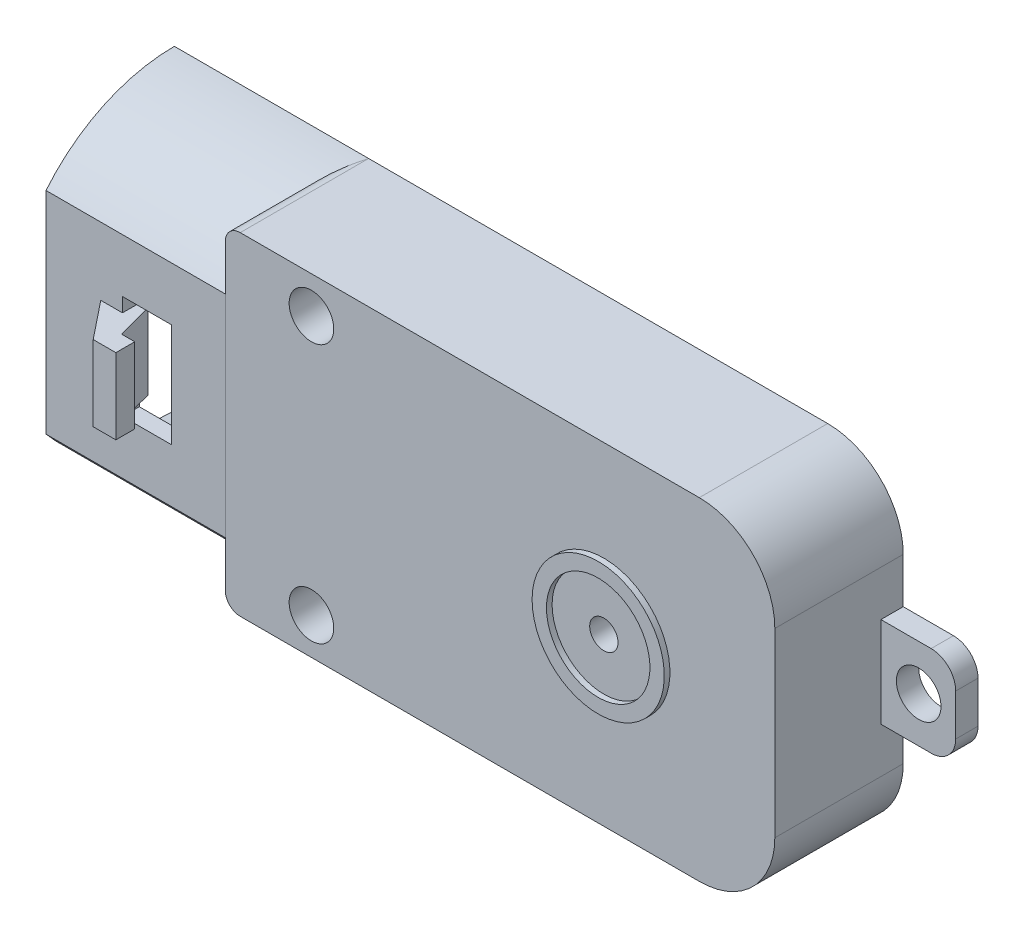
ISO-10303-21;
HEADER;
FILE_DESCRIPTION(('STEP AP214'),'2;1');
FILE_NAME('part.step','',(''),(''),'','','');
FILE_SCHEMA(('AUTOMOTIVE_DESIGN { 1 0 10303 214 1 1 1 1 }'));
ENDSEC;
DATA;
#1=APPLICATION_CONTEXT('core data for automotive mechanical design processes');
#2=APPLICATION_PROTOCOL_DEFINITION('international standard','automotive_design',2000,#1);
#3=PRODUCT_CONTEXT('',#1,'mechanical');
#4=PRODUCT('Part','Part','',(#3));
#5=PRODUCT_RELATED_PRODUCT_CATEGORY('part','',(#4));
#6=PRODUCT_DEFINITION_FORMATION('','',#4);
#7=PRODUCT_DEFINITION_CONTEXT('part definition',#1,'design');
#8=PRODUCT_DEFINITION('design','',#6,#7);
#9=PRODUCT_DEFINITION_SHAPE('','',#8);
#10=(LENGTH_UNIT() NAMED_UNIT(*) SI_UNIT(.MILLI.,.METRE.));
#11=(NAMED_UNIT(*) PLANE_ANGLE_UNIT() SI_UNIT($,.RADIAN.));
#12=(NAMED_UNIT(*) SI_UNIT($,.STERADIAN.) SOLID_ANGLE_UNIT());
#13=UNCERTAINTY_MEASURE_WITH_UNIT(LENGTH_MEASURE(1.E-05),#10,'distance_accuracy_value','');
#14=(GEOMETRIC_REPRESENTATION_CONTEXT(3) GLOBAL_UNCERTAINTY_ASSIGNED_CONTEXT((#13)) GLOBAL_UNIT_ASSIGNED_CONTEXT((#10,
#11,#12)) REPRESENTATION_CONTEXT('',''));
#15=CARTESIAN_POINT('',(0.,0.,0.));
#16=DIRECTION('',(0.,0.,1.));
#17=DIRECTION('',(1.,0.,0.));
#18=AXIS2_PLACEMENT_3D('',#15,#16,#17);
#19=CARTESIAN_POINT('',(-32.3785,3.4925,-1.36654));
#20=DIRECTION('',(-1.,0.,0.));
#21=DIRECTION('',(0.,0.,1.));
#22=AXIS2_PLACEMENT_3D('',#19,#20,#21);
#23=PLANE('',#22);
#24=DIRECTION('',(0.,0.,-1.));
#25=VECTOR('',#24,1.);
#26=CARTESIAN_POINT('',(-32.3785,2.54,7.50346));
#27=LINE('',#26,#25);
#28=CARTESIAN_POINT('',(-32.3785,2.54,8.63346));
#29=VERTEX_POINT('',#28);
#30=CARTESIAN_POINT('',(-32.3785,2.54,7.50346));
#31=VERTEX_POINT('',#30);
#32=EDGE_CURVE('E338',#29,#31,#27,.T.);
#33=ORIENTED_EDGE('',*,*,#32,.T.);
#34=DIRECTION('',(0.,1.,0.));
#35=VECTOR('',#34,1.);
#36=CARTESIAN_POINT('',(-32.3785,3.4925,7.50346));
#37=LINE('',#36,#35);
#38=CARTESIAN_POINT('',(-32.3785,3.4925,7.50346));
#39=VERTEX_POINT('',#38);
#40=EDGE_CURVE('E391',#31,#39,#37,.T.);
#41=ORIENTED_EDGE('',*,*,#40,.T.);
#42=DIRECTION('',(0.,0.,1.));
#43=VECTOR('',#42,1.);
#44=CARTESIAN_POINT('',(-32.3785,3.4925,-1.36654));
#45=LINE('',#44,#43);
#46=CARTESIAN_POINT('',(-32.3785,3.4925,8.63346));
#47=VERTEX_POINT('',#46);
#48=EDGE_CURVE('E426',#39,#47,#45,.T.);
#49=ORIENTED_EDGE('',*,*,#48,.T.);
#50=DIRECTION('',(0.,-1.,0.));
#51=VECTOR('',#50,1.);
#52=CARTESIAN_POINT('',(-32.3785,3.4925,8.63346));
#53=LINE('',#52,#51);
#54=EDGE_CURVE('E413',#47,#29,#53,.T.);
#55=ORIENTED_EDGE('',*,*,#54,.T.);
#56=EDGE_LOOP('',(#33,#41,#49,#55));
#57=FACE_BOUND('',#56,.T.);
#58=ADVANCED_FACE('F46',(#57),#23,.F.);
#59=CARTESIAN_POINT('',(11.5,11.176,8.636));
#60=DIRECTION('',(0.,0.,-1.));
#61=DIRECTION('',(-1.,0.,0.));
#62=AXIS2_PLACEMENT_3D('',#59,#60,#61);
#63=PLANE('',#62);
#64=CARTESIAN_POINT('',(-19.6658,8.7122,8.636));
#65=DIRECTION('',(0.,0.,1.));
#66=DIRECTION('',(1.,0.,0.));
#67=AXIS2_PLACEMENT_3D('',#64,#65,#66);
#68=CIRCLE('',#67,1.5);
#69=CARTESIAN_POINT('',(-18.1658,8.7122,8.636));
#70=VERTEX_POINT('',#69);
#71=EDGE_CURVE('E468',#70,#70,#68,.T.);
#72=ORIENTED_EDGE('',*,*,#71,.F.);
#73=EDGE_LOOP('',(#72));
#74=FACE_BOUND('',#73,.T.);
#75=CARTESIAN_POINT('',(-19.6658,-8.7122,8.636));
#76=DIRECTION('',(0.,0.,-1.));
#77=DIRECTION('',(1.,0.,0.));
#78=AXIS2_PLACEMENT_3D('',#75,#76,#77);
#79=CIRCLE('',#78,1.5);
#80=CARTESIAN_POINT('',(-18.1658,-8.7122,8.636));
#81=VERTEX_POINT('',#80);
#82=EDGE_CURVE('E464',#81,#81,#79,.T.);
#83=ORIENTED_EDGE('',*,*,#82,.T.);
#84=EDGE_LOOP('',(#83));
#85=FACE_BOUND('',#84,.T.);
#86=CARTESIAN_POINT('',(0.,0.,8.636));
#87=DIRECTION('',(0.,0.,-1.));
#88=DIRECTION('',(-1.,0.,0.));
#89=AXIS2_PLACEMENT_3D('',#86,#87,#88);
#90=CIRCLE('',#89,4.445);
#91=CARTESIAN_POINT('',(-4.445,0.,8.636));
#92=VERTEX_POINT('',#91);
#93=EDGE_CURVE('E524',#92,#92,#90,.F.);
#94=ORIENTED_EDGE('',*,*,#93,.F.);
#95=EDGE_LOOP('',(#94));
#96=FACE_BOUND('',#95,.T.);
#97=DIRECTION('',(0.,1.,0.));
#98=VECTOR('',#97,1.);
#99=CARTESIAN_POINT('',(-25.457,11.176,8.636));
#100=LINE('',#99,#98);
#101=CARTESIAN_POINT('',(-25.457,-10.176,8.636));
#102=VERTEX_POINT('',#101);
#103=CARTESIAN_POINT('',(-25.457,10.176,8.636));
#104=VERTEX_POINT('',#103);
#105=EDGE_CURVE('E451',#102,#104,#100,.T.);
#106=ORIENTED_EDGE('',*,*,#105,.F.);
#107=CARTESIAN_POINT('',(-24.457,-10.176,8.636));
#108=DIRECTION('',(0.,0.,-1.));
#109=DIRECTION('',(-1.,0.,0.));
#110=AXIS2_PLACEMENT_3D('',#107,#108,#109);
#111=CIRCLE('',#110,1.);
#112=CARTESIAN_POINT('',(-24.457,-11.176,8.636));
#113=VERTEX_POINT('',#112);
#114=EDGE_CURVE('E535',#102,#113,#111,.F.);
#115=ORIENTED_EDGE('',*,*,#114,.T.);
#116=DIRECTION('',(1.,0.,0.));
#117=VECTOR('',#116,1.);
#118=CARTESIAN_POINT('',(11.5,-11.176,8.636));
#119=LINE('',#118,#117);
#120=CARTESIAN_POINT('',(6.42,-11.176,8.636));
#121=VERTEX_POINT('',#120);
#122=EDGE_CURVE('E490',#113,#121,#119,.T.);
#123=ORIENTED_EDGE('',*,*,#122,.T.);
#124=CARTESIAN_POINT('',(6.42,-6.096,8.636));
#125=DIRECTION('',(0.,0.,-1.));
#126=DIRECTION('',(-1.,0.,0.));
#127=AXIS2_PLACEMENT_3D('',#124,#125,#126);
#128=CIRCLE('',#127,5.08);
#129=CARTESIAN_POINT('',(11.5,-6.096,8.636));
#130=VERTEX_POINT('',#129);
#131=EDGE_CURVE('E519',#121,#130,#128,.F.);
#132=ORIENTED_EDGE('',*,*,#131,.T.);
#133=DIRECTION('',(0.,1.,0.));
#134=VECTOR('',#133,1.);
#135=CARTESIAN_POINT('',(11.5,11.176,8.636));
#136=LINE('',#135,#134);
#137=CARTESIAN_POINT('',(11.5,6.096,8.636));
#138=VERTEX_POINT('',#137);
#139=EDGE_CURVE('E483',#130,#138,#136,.T.);
#140=ORIENTED_EDGE('',*,*,#139,.T.);
#141=CARTESIAN_POINT('',(6.42,6.096,8.636));
#142=DIRECTION('',(0.,0.,-1.));
#143=DIRECTION('',(-1.,0.,0.));
#144=AXIS2_PLACEMENT_3D('',#141,#142,#143);
#145=CIRCLE('',#144,5.08);
#146=CARTESIAN_POINT('',(6.42,11.176,8.636));
#147=VERTEX_POINT('',#146);
#148=EDGE_CURVE('E517',#138,#147,#145,.F.);
#149=ORIENTED_EDGE('',*,*,#148,.T.);
#150=DIRECTION('',(-1.,0.,0.));
#151=VECTOR('',#150,1.);
#152=CARTESIAN_POINT('',(11.5,11.176,8.636));
#153=LINE('',#152,#151);
#154=CARTESIAN_POINT('',(-24.457,11.176,8.636));
#155=VERTEX_POINT('',#154);
#156=EDGE_CURVE('E486',#147,#155,#153,.T.);
#157=ORIENTED_EDGE('',*,*,#156,.T.);
#158=CARTESIAN_POINT('',(-24.457,10.176,8.636));
#159=DIRECTION('',(0.,0.,-1.));
#160=DIRECTION('',(-1.,0.,0.));
#161=AXIS2_PLACEMENT_3D('',#158,#159,#160);
#162=CIRCLE('',#161,1.);
#163=EDGE_CURVE('E533',#155,#104,#162,.F.);
#164=ORIENTED_EDGE('',*,*,#163,.T.);
#165=EDGE_LOOP('',(#106,#115,#123,#132,#140,#149,#157,#164));
#166=FACE_BOUND('',#165,.T.);
#167=ADVANCED_FACE('F607',(#74,#85,#96,#166),#63,.F.);
#168=CARTESIAN_POINT('',(11.5,-11.176,8.636));
#169=DIRECTION('',(0.,1.,0.));
#170=DIRECTION('',(-1.,0.,0.));
#171=AXIS2_PLACEMENT_3D('',#168,#169,#170);
#172=PLANE('',#171);
#173=ORIENTED_EDGE('',*,*,#122,.F.);
#174=DIRECTION('',(0.,0.,1.));
#175=VECTOR('',#174,1.);
#176=CARTESIAN_POINT('',(-24.457,-11.176,0.));
#177=LINE('',#176,#175);
#178=CARTESIAN_POINT('',(-24.457,-11.176,0.));
#179=VERTEX_POINT('',#178);
#180=EDGE_CURVE('E537',#113,#179,#177,.F.);
#181=ORIENTED_EDGE('',*,*,#180,.T.);
#182=DIRECTION('',(1.,0.,0.));
#183=VECTOR('',#182,1.);
#184=CARTESIAN_POINT('',(11.5,-11.176,0.));
#185=LINE('',#184,#183);
#186=CARTESIAN_POINT('',(6.42,-11.176,0.));
#187=VERTEX_POINT('',#186);
#188=EDGE_CURVE('E502',#179,#187,#185,.T.);
#189=ORIENTED_EDGE('',*,*,#188,.T.);
#190=DIRECTION('',(0.,0.,-1.));
#191=VECTOR('',#190,1.);
#192=CARTESIAN_POINT('',(6.42,-11.176,8.636));
#193=LINE('',#192,#191);
#194=EDGE_CURVE('E514',#187,#121,#193,.F.);
#195=ORIENTED_EDGE('',*,*,#194,.T.);
#196=EDGE_LOOP('',(#173,#181,#189,#195));
#197=FACE_BOUND('',#196,.T.);
#198=ADVANCED_FACE('F611',(#197),#172,.F.);
#199=CARTESIAN_POINT('',(11.5,11.176,8.636));
#200=DIRECTION('',(0.,-1.,0.));
#201=DIRECTION('',(1.,0.,0.));
#202=AXIS2_PLACEMENT_3D('',#199,#200,#201);
#203=PLANE('',#202);
#204=DIRECTION('',(-1.,0.,0.));
#205=VECTOR('',#204,1.);
#206=CARTESIAN_POINT('',(11.5,11.176,0.));
#207=LINE('',#206,#205);
#208=CARTESIAN_POINT('',(6.42,11.176,0.));
#209=VERTEX_POINT('',#208);
#210=CARTESIAN_POINT('',(-24.457,11.176,0.));
#211=VERTEX_POINT('',#210);
#212=EDGE_CURVE('E495',#209,#211,#207,.T.);
#213=ORIENTED_EDGE('',*,*,#212,.T.);
#214=DIRECTION('',(0.,0.,-1.));
#215=VECTOR('',#214,1.);
#216=CARTESIAN_POINT('',(-24.457,11.176,8.636));
#217=LINE('',#216,#215);
#218=EDGE_CURVE('E540',#211,#155,#217,.F.);
#219=ORIENTED_EDGE('',*,*,#218,.T.);
#220=ORIENTED_EDGE('',*,*,#156,.F.);
#221=DIRECTION('',(0.,0.,-1.));
#222=VECTOR('',#221,1.);
#223=CARTESIAN_POINT('',(6.42,11.176,8.636));
#224=LINE('',#223,#222);
#225=EDGE_CURVE('E521',#147,#209,#224,.T.);
#226=ORIENTED_EDGE('',*,*,#225,.T.);
#227=EDGE_LOOP('',(#213,#219,#220,#226));
#228=FACE_BOUND('',#227,.T.);
#229=ADVANCED_FACE('F614',(#228),#203,.F.);
#230=CARTESIAN_POINT('',(-37.522,11.176,8.636));
#231=DIRECTION('',(1.,0.,0.));
#232=DIRECTION('',(0.,0.,-1.));
#233=AXIS2_PLACEMENT_3D('',#230,#231,#232);
#234=PLANE('',#233);
#235=DIRECTION('',(0.,-1.,0.));
#236=VECTOR('',#235,1.);
#237=CARTESIAN_POINT('',(-37.522,11.176,0.));
#238=LINE('',#237,#236);
#239=CARTESIAN_POINT('',(-37.522,11.176,0.));
#240=VERTEX_POINT('',#239);
#241=CARTESIAN_POINT('',(-37.522,10.046,0.));
#242=VERTEX_POINT('',#241);
#243=EDGE_CURVE('E499',#240,#242,#238,.T.);
#244=ORIENTED_EDGE('',*,*,#243,.T.);
#245=CARTESIAN_POINT('',(-37.522,0.,0.));
#246=DIRECTION('',(-1.,0.,0.));
#247=DIRECTION('',(0.,0.,1.));
#248=AXIS2_PLACEMENT_3D('',#245,#246,#247);
#249=CIRCLE('',#248,10.046);
#250=CARTESIAN_POINT('',(-37.522,6.67983562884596,7.50346));
#251=VERTEX_POINT('',#250);
#252=EDGE_CURVE('E369',#251,#242,#249,.T.);
#253=ORIENTED_EDGE('',*,*,#252,.F.);
#254=DIRECTION('',(0.,1.,0.));
#255=VECTOR('',#254,1.);
#256=CARTESIAN_POINT('',(-37.522,-6.67983562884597,7.50346));
#257=LINE('',#256,#255);
#258=CARTESIAN_POINT('',(-37.522,-6.67983562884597,7.50346));
#259=VERTEX_POINT('',#258);
#260=EDGE_CURVE('E373',#259,#251,#257,.T.);
#261=ORIENTED_EDGE('',*,*,#260,.F.);
#262=CARTESIAN_POINT('',(-37.522,0.,0.));
#263=DIRECTION('',(-1.,0.,0.));
#264=DIRECTION('',(0.,0.,1.));
#265=AXIS2_PLACEMENT_3D('',#262,#263,#264);
#266=CIRCLE('',#265,10.046);
#267=CARTESIAN_POINT('',(-37.522,-10.046,0.));
#268=VERTEX_POINT('',#267);
#269=EDGE_CURVE('E384',#268,#259,#266,.T.);
#270=ORIENTED_EDGE('',*,*,#269,.F.);
#271=CARTESIAN_POINT('',(-37.522,-11.176,0.));
#272=VERTEX_POINT('',#271);
#273=EDGE_CURVE('E498',#268,#272,#238,.T.);
#274=ORIENTED_EDGE('',*,*,#273,.T.);
#275=CARTESIAN_POINT('',(-37.522,0.,0.));
#276=DIRECTION('',(1.,0.,0.));
#277=DIRECTION('',(0.,0.,1.));
#278=AXIS2_PLACEMENT_3D('',#275,#276,#277);
#279=CIRCLE('',#278,11.176);
#280=CARTESIAN_POINT('',(-37.522,-7.09692499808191,8.63346));
#281=VERTEX_POINT('',#280);
#282=EDGE_CURVE('E422',#281,#272,#279,.T.);
#283=ORIENTED_EDGE('',*,*,#282,.F.);
#284=DIRECTION('',(0.,1.,0.));
#285=VECTOR('',#284,1.);
#286=CARTESIAN_POINT('',(-37.522,7.09692499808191,8.63346));
#287=LINE('',#286,#285);
#288=CARTESIAN_POINT('',(-37.522,7.09692499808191,8.63346));
#289=VERTEX_POINT('',#288);
#290=EDGE_CURVE('E442',#281,#289,#287,.T.);
#291=ORIENTED_EDGE('',*,*,#290,.T.);
#292=CARTESIAN_POINT('',(-37.522,0.,0.));
#293=DIRECTION('',(-1.,0.,0.));
#294=DIRECTION('',(0.,0.,1.));
#295=AXIS2_PLACEMENT_3D('',#292,#293,#294);
#296=CIRCLE('',#295,11.176);
#297=EDGE_CURVE('E437',#289,#240,#296,.T.);
#298=ORIENTED_EDGE('',*,*,#297,.T.);
#299=EDGE_LOOP('',(#244,#253,#261,#270,#274,#283,#291,#298));
#300=FACE_BOUND('',#299,.T.);
#301=ADVANCED_FACE('F605',(#300),#234,.F.);
#302=CARTESIAN_POINT('',(0.,0.,8.636));
#303=DIRECTION('',(0.,0.,1.));
#304=DIRECTION('',(1.,0.,0.));
#305=AXIS2_PLACEMENT_3D('',#302,#303,#304);
#306=CIRCLE('',#305,3.4798);
#307=CARTESIAN_POINT('',(-3.4798,0.,8.636));
#308=VERTEX_POINT('',#307);
#309=EDGE_CURVE('E455',#308,#308,#306,.T.);
#310=ORIENTED_EDGE('',*,*,#309,.T.);
#311=EDGE_LOOP('',(#310));
#312=FACE_BOUND('',#311,.T.);
#313=CARTESIAN_POINT('',(0.,0.,8.636));
#314=DIRECTION('',(0.,0.,1.));
#315=DIRECTION('',(1.,0.,0.));
#316=AXIS2_PLACEMENT_3D('',#313,#314,#315);
#317=CIRCLE('',#316,0.9525);
#318=CARTESIAN_POINT('',(0.9525,0.,8.636));
#319=VERTEX_POINT('',#318);
#320=EDGE_CURVE('E474',#319,#319,#317,.T.);
#321=ORIENTED_EDGE('',*,*,#320,.F.);
#322=EDGE_LOOP('',(#321));
#323=FACE_BOUND('',#322,.T.);
#324=ADVANCED_FACE('F601',(#312,#323),#63,.F.);
#325=CARTESIAN_POINT('',(11.5,11.176,0.));
#326=DIRECTION('',(0.,0.,-1.));
#327=DIRECTION('',(-1.,0.,0.));
#328=AXIS2_PLACEMENT_3D('',#325,#326,#327);
#329=PLANE('',#328);
#330=DIRECTION('',(-1.,0.,0.));
#331=VECTOR('',#330,1.);
#332=CARTESIAN_POINT('',(-25.522,10.046,0.));
#333=LINE('',#332,#331);
#334=CARTESIAN_POINT('',(-25.522,10.046,0.));
#335=VERTEX_POINT('',#334);
#336=EDGE_CURVE('E382',#335,#242,#333,.T.);
#337=ORIENTED_EDGE('',*,*,#336,.T.);
#338=ORIENTED_EDGE('',*,*,#243,.F.);
#339=DIRECTION('',(-1.,0.,0.));
#340=VECTOR('',#339,1.);
#341=CARTESIAN_POINT('',(-25.457,11.176,0.));
#342=LINE('',#341,#340);
#343=EDGE_CURVE('E444',#211,#240,#342,.T.);
#344=ORIENTED_EDGE('',*,*,#343,.F.);
#345=ORIENTED_EDGE('',*,*,#212,.F.);
#346=CARTESIAN_POINT('',(6.42,6.096,0.));
#347=DIRECTION('',(0.,0.,-1.));
#348=DIRECTION('',(-1.,0.,0.));
#349=AXIS2_PLACEMENT_3D('',#346,#347,#348);
#350=CIRCLE('',#349,5.08);
#351=CARTESIAN_POINT('',(11.5,6.096,0.));
#352=VERTEX_POINT('',#351);
#353=EDGE_CURVE('E508',#209,#352,#350,.T.);
#354=ORIENTED_EDGE('',*,*,#353,.T.);
#355=DIRECTION('',(0.,1.,0.));
#356=VECTOR('',#355,1.);
#357=CARTESIAN_POINT('',(11.5,11.176,0.));
#358=LINE('',#357,#356);
#359=CARTESIAN_POINT('',(11.5,3.048,0.));
#360=VERTEX_POINT('',#359);
#361=EDGE_CURVE('E480',#360,#352,#358,.T.);
#362=ORIENTED_EDGE('',*,*,#361,.F.);
#363=DIRECTION('',(1.,0.,0.));
#364=VECTOR('',#363,1.);
#365=CARTESIAN_POINT('',(11.5,3.048,0.));
#366=LINE('',#365,#364);
#367=CARTESIAN_POINT('',(14.8782,3.048,0.));
#368=VERTEX_POINT('',#367);
#369=EDGE_CURVE('E296',#360,#368,#366,.T.);
#370=ORIENTED_EDGE('',*,*,#369,.T.);
#371=CARTESIAN_POINT('',(14.8782,1.397,0.));
#372=DIRECTION('',(0.,0.,-1.));
#373=DIRECTION('',(-1.,0.,0.));
#374=AXIS2_PLACEMENT_3D('',#371,#372,#373);
#375=CIRCLE('',#374,1.651);
#376=CARTESIAN_POINT('',(16.5292,1.397,0.));
#377=VERTEX_POINT('',#376);
#378=EDGE_CURVE('E266',#368,#377,#375,.T.);
#379=ORIENTED_EDGE('',*,*,#378,.T.);
#380=DIRECTION('',(0.,-1.,0.));
#381=VECTOR('',#380,1.);
#382=CARTESIAN_POINT('',(16.5292,1.397,0.));
#383=LINE('',#382,#381);
#384=CARTESIAN_POINT('',(16.5292,-1.397,0.));
#385=VERTEX_POINT('',#384);
#386=EDGE_CURVE('E300',#377,#385,#383,.T.);
#387=ORIENTED_EDGE('',*,*,#386,.T.);
#388=CARTESIAN_POINT('',(14.8782,-1.397,0.));
#389=DIRECTION('',(0.,0.,-1.));
#390=DIRECTION('',(1.,0.,0.));
#391=AXIS2_PLACEMENT_3D('',#388,#389,#390);
#392=CIRCLE('',#391,1.651);
#393=CARTESIAN_POINT('',(14.8782,-3.048,0.));
#394=VERTEX_POINT('',#393);
#395=EDGE_CURVE('E303',#385,#394,#392,.T.);
#396=ORIENTED_EDGE('',*,*,#395,.T.);
#397=DIRECTION('',(-1.,0.,0.));
#398=VECTOR('',#397,1.);
#399=CARTESIAN_POINT('',(11.5,-3.048,0.));
#400=LINE('',#399,#398);
#401=CARTESIAN_POINT('',(11.5,-3.048,0.));
#402=VERTEX_POINT('',#401);
#403=EDGE_CURVE('E285',#394,#402,#400,.T.);
#404=ORIENTED_EDGE('',*,*,#403,.T.);
#405=CARTESIAN_POINT('',(11.5,-6.096,0.));
#406=VERTEX_POINT('',#405);
#407=EDGE_CURVE('E493',#406,#402,#358,.T.);
#408=ORIENTED_EDGE('',*,*,#407,.F.);
#409=CARTESIAN_POINT('',(6.42,-6.096,0.));
#410=DIRECTION('',(0.,0.,-1.));
#411=DIRECTION('',(-1.,0.,0.));
#412=AXIS2_PLACEMENT_3D('',#409,#410,#411);
#413=CIRCLE('',#412,5.08);
#414=EDGE_CURVE('E511',#406,#187,#413,.T.);
#415=ORIENTED_EDGE('',*,*,#414,.T.);
#416=ORIENTED_EDGE('',*,*,#188,.F.);
#417=EDGE_CURVE('E487',#272,#179,#185,.T.);
#418=ORIENTED_EDGE('',*,*,#417,.F.);
#419=ORIENTED_EDGE('',*,*,#273,.F.);
#420=DIRECTION('',(-1.,0.,0.));
#421=VECTOR('',#420,1.);
#422=CARTESIAN_POINT('',(-25.522,-10.046,0.));
#423=LINE('',#422,#421);
#424=CARTESIAN_POINT('',(-25.522,-10.046,0.));
#425=VERTEX_POINT('',#424);
#426=EDGE_CURVE('E394',#425,#268,#423,.T.);
#427=ORIENTED_EDGE('',*,*,#426,.F.);
#428=DIRECTION('',(0.,-1.,0.));
#429=VECTOR('',#428,1.);
#430=CARTESIAN_POINT('',(-25.522,10.046,0.));
#431=LINE('',#430,#429);
#432=EDGE_CURVE('E372',#335,#425,#431,.T.);
#433=ORIENTED_EDGE('',*,*,#432,.F.);
#434=EDGE_LOOP('',(#337,#338,#344,#345,#354,#362,#370,#379,#387,#396,#404,#408,#415,#416,#418,
#419,#427,#433));
#435=FACE_BOUND('',#434,.T.);
#436=CARTESIAN_POINT('',(0.,0.,0.));
#437=DIRECTION('',(0.,0.,1.));
#438=DIRECTION('',(1.,0.,0.));
#439=AXIS2_PLACEMENT_3D('',#436,#437,#438);
#440=CIRCLE('',#439,0.9525);
#441=CARTESIAN_POINT('',(0.9525,0.,0.));
#442=VERTEX_POINT('',#441);
#443=EDGE_CURVE('E477',#442,#442,#440,.T.);
#444=ORIENTED_EDGE('',*,*,#443,.T.);
#445=EDGE_LOOP('',(#444));
#446=FACE_BOUND('',#445,.T.);
#447=CARTESIAN_POINT('',(-19.6658,8.7122,0.));
#448=DIRECTION('',(0.,0.,1.));
#449=DIRECTION('',(1.,0.,0.));
#450=AXIS2_PLACEMENT_3D('',#447,#448,#449);
#451=CIRCLE('',#450,1.5);
#452=CARTESIAN_POINT('',(-18.1658,8.7122,0.));
#453=VERTEX_POINT('',#452);
#454=EDGE_CURVE('E471',#453,#453,#451,.T.);
#455=ORIENTED_EDGE('',*,*,#454,.T.);
#456=EDGE_LOOP('',(#455));
#457=FACE_BOUND('',#456,.T.);
#458=CARTESIAN_POINT('',(-19.6658,-8.7122,0.));
#459=DIRECTION('',(0.,0.,-1.));
#460=DIRECTION('',(1.,0.,0.));
#461=AXIS2_PLACEMENT_3D('',#458,#459,#460);
#462=CIRCLE('',#461,1.5);
#463=CARTESIAN_POINT('',(-18.1658,-8.7122,0.));
#464=VERTEX_POINT('',#463);
#465=EDGE_CURVE('E465',#464,#464,#462,.T.);
#466=ORIENTED_EDGE('',*,*,#465,.F.);
#467=EDGE_LOOP('',(#466));
#468=FACE_BOUND('',#467,.T.);
#469=CARTESIAN_POINT('',(14.04,0.,0.));
#470=DIRECTION('',(0.,0.,-1.));
#471=DIRECTION('',(-1.,0.,0.));
#472=AXIS2_PLACEMENT_3D('',#469,#470,#471);
#473=CIRCLE('',#472,1.5);
#474=CARTESIAN_POINT('',(12.54,0.,0.));
#475=VERTEX_POINT('',#474);
#476=EDGE_CURVE('E787',#475,#475,#473,.T.);
#477=ORIENTED_EDGE('',*,*,#476,.F.);
#478=EDGE_LOOP('',(#477));
#479=FACE_BOUND('',#478,.T.);
#480=ADVANCED_FACE('F604',(#435,#446,#457,#468,#479),#329,.T.);
#481=CARTESIAN_POINT('',(11.5,11.176,8.636));
#482=DIRECTION('',(-1.,0.,0.));
#483=DIRECTION('',(0.,-1.,0.));
#484=AXIS2_PLACEMENT_3D('',#481,#482,#483);
#485=PLANE('',#484);
#486=ORIENTED_EDGE('',*,*,#407,.T.);
#487=DIRECTION('',(0.,0.,-1.));
#488=VECTOR('',#487,1.);
#489=CARTESIAN_POINT('',(11.5,-3.048,1.5));
#490=LINE('',#489,#488);
#491=CARTESIAN_POINT('',(11.5,-3.048,1.5));
#492=VERTEX_POINT('',#491);
#493=EDGE_CURVE('E67',#492,#402,#490,.T.);
#494=ORIENTED_EDGE('',*,*,#493,.F.);
#495=DIRECTION('',(0.,1.,0.));
#496=VECTOR('',#495,1.);
#497=CARTESIAN_POINT('',(11.5,3.048,1.5));
#498=LINE('',#497,#496);
#499=CARTESIAN_POINT('',(11.5,3.048,1.5));
#500=VERTEX_POINT('',#499);
#501=EDGE_CURVE('E62',#492,#500,#498,.T.);
#502=ORIENTED_EDGE('',*,*,#501,.T.);
#503=DIRECTION('',(0.,0.,-1.));
#504=VECTOR('',#503,1.);
#505=CARTESIAN_POINT('',(11.5,3.048,1.5));
#506=LINE('',#505,#504);
#507=EDGE_CURVE('E272',#500,#360,#506,.T.);
#508=ORIENTED_EDGE('',*,*,#507,.T.);
#509=ORIENTED_EDGE('',*,*,#361,.T.);
#510=DIRECTION('',(0.,0.,-1.));
#511=VECTOR('',#510,1.);
#512=CARTESIAN_POINT('',(11.5,6.096,8.636));
#513=LINE('',#512,#511);
#514=EDGE_CURVE('E492',#352,#138,#513,.F.);
#515=ORIENTED_EDGE('',*,*,#514,.T.);
#516=ORIENTED_EDGE('',*,*,#139,.F.);
#517=DIRECTION('',(0.,0.,-1.));
#518=VECTOR('',#517,1.);
#519=CARTESIAN_POINT('',(11.5,-6.096,8.636));
#520=LINE('',#519,#518);
#521=EDGE_CURVE('E505',#130,#406,#520,.T.);
#522=ORIENTED_EDGE('',*,*,#521,.T.);
#523=EDGE_LOOP('',(#486,#494,#502,#508,#509,#515,#516,#522));
#524=FACE_BOUND('',#523,.T.);
#525=ADVANCED_FACE('F599',(#524),#485,.F.);
#526=CARTESIAN_POINT('',(0.,0.,0.));
#527=DIRECTION('',(0.,0.,1.));
#528=DIRECTION('',(1.,0.,0.));
#529=AXIS2_PLACEMENT_3D('',#526,#527,#528);
#530=CYLINDRICAL_SURFACE('',#529,0.9525);
#531=ORIENTED_EDGE('',*,*,#443,.F.);
#532=EDGE_LOOP('',(#531));
#533=FACE_BOUND('',#532,.T.);
#534=ORIENTED_EDGE('',*,*,#320,.T.);
#535=EDGE_LOOP('',(#534));
#536=FACE_BOUND('',#535,.T.);
#537=ADVANCED_FACE('F595',(#533,#536),#530,.F.);
#538=CARTESIAN_POINT('',(-19.6658,8.7122,0.));
#539=DIRECTION('',(0.,0.,1.));
#540=DIRECTION('',(1.,0.,0.));
#541=AXIS2_PLACEMENT_3D('',#538,#539,#540);
#542=CYLINDRICAL_SURFACE('',#541,1.5);
#543=ORIENTED_EDGE('',*,*,#454,.F.);
#544=EDGE_LOOP('',(#543));
#545=FACE_BOUND('',#544,.T.);
#546=ORIENTED_EDGE('',*,*,#71,.T.);
#547=EDGE_LOOP('',(#546));
#548=FACE_BOUND('',#547,.T.);
#549=ADVANCED_FACE('F591',(#545,#548),#542,.F.);
#550=CARTESIAN_POINT('',(-19.6658,-8.7122,0.));
#551=DIRECTION('',(0.,0.,1.));
#552=DIRECTION('',(1.,0.,0.));
#553=AXIS2_PLACEMENT_3D('',#550,#551,#552);
#554=CYLINDRICAL_SURFACE('',#553,1.5);
#555=ORIENTED_EDGE('',*,*,#465,.T.);
#556=EDGE_LOOP('',(#555));
#557=FACE_BOUND('',#556,.T.);
#558=ORIENTED_EDGE('',*,*,#82,.F.);
#559=EDGE_LOOP('',(#558));
#560=FACE_BOUND('',#559,.T.);
#561=ADVANCED_FACE('F587',(#557,#560),#554,.F.);
#562=CARTESIAN_POINT('',(6.42,-6.096,8.636));
#563=DIRECTION('',(0.,0.,-1.));
#564=DIRECTION('',(-1.,0.,0.));
#565=AXIS2_PLACEMENT_3D('',#562,#563,#564);
#566=CYLINDRICAL_SURFACE('',#565,5.08);
#567=ORIENTED_EDGE('',*,*,#131,.F.);
#568=ORIENTED_EDGE('',*,*,#194,.F.);
#569=ORIENTED_EDGE('',*,*,#414,.F.);
#570=ORIENTED_EDGE('',*,*,#521,.F.);
#571=EDGE_LOOP('',(#567,#568,#569,#570));
#572=FACE_BOUND('',#571,.T.);
#573=ADVANCED_FACE('F590',(#572),#566,.T.);
#574=CARTESIAN_POINT('',(6.42,6.096,8.636));
#575=DIRECTION('',(0.,0.,-1.));
#576=DIRECTION('',(-1.,0.,0.));
#577=AXIS2_PLACEMENT_3D('',#574,#575,#576);
#578=CYLINDRICAL_SURFACE('',#577,5.08);
#579=ORIENTED_EDGE('',*,*,#148,.F.);
#580=ORIENTED_EDGE('',*,*,#514,.F.);
#581=ORIENTED_EDGE('',*,*,#353,.F.);
#582=ORIENTED_EDGE('',*,*,#225,.F.);
#583=EDGE_LOOP('',(#579,#580,#581,#582));
#584=FACE_BOUND('',#583,.T.);
#585=ADVANCED_FACE('F582',(#584),#578,.T.);
#586=CARTESIAN_POINT('',(0.,0.,9.017));
#587=DIRECTION('',(0.,0.,1.));
#588=DIRECTION('',(1.,0.,0.));
#589=AXIS2_PLACEMENT_3D('',#586,#587,#588);
#590=PLANE('',#589);
#591=CARTESIAN_POINT('',(0.,0.,9.017));
#592=DIRECTION('',(0.,0.,1.));
#593=DIRECTION('',(1.,0.,0.));
#594=AXIS2_PLACEMENT_3D('',#591,#592,#593);
#595=CIRCLE('',#594,4.445);
#596=CARTESIAN_POINT('',(-4.445,0.,9.017));
#597=VERTEX_POINT('',#596);
#598=EDGE_CURVE('E459',#597,#597,#595,.T.);
#599=ORIENTED_EDGE('',*,*,#598,.T.);
#600=EDGE_LOOP('',(#599));
#601=FACE_BOUND('',#600,.T.);
#602=CARTESIAN_POINT('',(0.,0.,9.017));
#603=DIRECTION('',(0.,0.,1.));
#604=DIRECTION('',(1.,0.,0.));
#605=AXIS2_PLACEMENT_3D('',#602,#603,#604);
#606=CIRCLE('',#605,3.4798);
#607=CARTESIAN_POINT('',(-3.4798,0.,9.017));
#608=VERTEX_POINT('',#607);
#609=EDGE_CURVE('E456',#608,#608,#606,.T.);
#610=ORIENTED_EDGE('',*,*,#609,.F.);
#611=EDGE_LOOP('',(#610));
#612=FACE_BOUND('',#611,.T.);
#613=ADVANCED_FACE('F579',(#601,#612),#590,.T.);
#614=CARTESIAN_POINT('',(0.,0.,9.017));
#615=DIRECTION('',(0.,0.,-1.));
#616=DIRECTION('',(-1.,0.,0.));
#617=AXIS2_PLACEMENT_3D('',#614,#615,#616);
#618=CYLINDRICAL_SURFACE('',#617,4.445);
#619=CARTESIAN_POINT('',(-4.445,0.,9.017));
#620=CARTESIAN_POINT('',(-4.445,0.,9.01303125));
#621=CARTESIAN_POINT('',(-4.445,0.,9.0090625));
#622=CARTESIAN_POINT('',(-4.445,0.,9.001125));
#623=CARTESIAN_POINT('',(-4.445,0.,8.99715625));
#624=CARTESIAN_POINT('',(-4.445,0.,8.98921875));
#625=CARTESIAN_POINT('',(-4.445,0.,8.98525));
#626=CARTESIAN_POINT('',(-4.445,0.,8.9773125));
#627=CARTESIAN_POINT('',(-4.445,0.,8.97334375));
#628=CARTESIAN_POINT('',(-4.445,0.,8.96540625));
#629=CARTESIAN_POINT('',(-4.445,0.,8.9614375));
#630=CARTESIAN_POINT('',(-4.445,0.,8.9535));
#631=CARTESIAN_POINT('',(-4.445,0.,8.94953125));
#632=CARTESIAN_POINT('',(-4.445,0.,8.94159375));
#633=CARTESIAN_POINT('',(-4.445,0.,8.937625));
#634=CARTESIAN_POINT('',(-4.445,0.,8.9296875));
#635=CARTESIAN_POINT('',(-4.445,0.,8.92571875));
#636=CARTESIAN_POINT('',(-4.445,0.,8.91778125));
#637=CARTESIAN_POINT('',(-4.445,0.,8.9138125));
#638=CARTESIAN_POINT('',(-4.445,0.,8.905875));
#639=CARTESIAN_POINT('',(-4.445,0.,8.90190625));
#640=CARTESIAN_POINT('',(-4.445,0.,8.89396875));
#641=CARTESIAN_POINT('',(-4.445,0.,8.89));
#642=CARTESIAN_POINT('',(-4.445,0.,8.8820625));
#643=CARTESIAN_POINT('',(-4.445,0.,8.87809375));
#644=CARTESIAN_POINT('',(-4.445,0.,8.87015625));
#645=CARTESIAN_POINT('',(-4.445,0.,8.8661875));
#646=CARTESIAN_POINT('',(-4.445,0.,8.85825));
#647=CARTESIAN_POINT('',(-4.445,0.,8.85428125));
#648=CARTESIAN_POINT('',(-4.445,0.,8.84634375));
#649=CARTESIAN_POINT('',(-4.445,0.,8.842375));
#650=CARTESIAN_POINT('',(-4.445,0.,8.8344375));
#651=CARTESIAN_POINT('',(-4.445,0.,8.83046875));
#652=CARTESIAN_POINT('',(-4.445,0.,8.82253125));
#653=CARTESIAN_POINT('',(-4.445,0.,8.8185625));
#654=CARTESIAN_POINT('',(-4.445,0.,8.810625));
#655=CARTESIAN_POINT('',(-4.445,0.,8.80665625));
#656=CARTESIAN_POINT('',(-4.445,0.,8.79871875));
#657=CARTESIAN_POINT('',(-4.445,0.,8.79475));
#658=CARTESIAN_POINT('',(-4.445,0.,8.7868125));
#659=CARTESIAN_POINT('',(-4.445,0.,8.78284375));
#660=CARTESIAN_POINT('',(-4.445,0.,8.77490625));
#661=CARTESIAN_POINT('',(-4.445,0.,8.7709375));
#662=CARTESIAN_POINT('',(-4.445,0.,8.763));
#663=CARTESIAN_POINT('',(-4.445,0.,8.75903125));
#664=CARTESIAN_POINT('',(-4.445,0.,8.75109375));
#665=CARTESIAN_POINT('',(-4.445,0.,8.747125));
#666=CARTESIAN_POINT('',(-4.445,0.,8.7391875));
#667=CARTESIAN_POINT('',(-4.445,0.,8.73521875));
#668=CARTESIAN_POINT('',(-4.445,0.,8.72728125));
#669=CARTESIAN_POINT('',(-4.445,0.,8.7233125));
#670=CARTESIAN_POINT('',(-4.445,0.,8.715375));
#671=CARTESIAN_POINT('',(-4.445,0.,8.71140625));
#672=CARTESIAN_POINT('',(-4.445,0.,8.70346875));
#673=CARTESIAN_POINT('',(-4.445,0.,8.6995));
#674=CARTESIAN_POINT('',(-4.445,0.,8.6915625));
#675=CARTESIAN_POINT('',(-4.445,0.,8.68759375));
#676=CARTESIAN_POINT('',(-4.445,0.,8.67965625));
#677=CARTESIAN_POINT('',(-4.445,0.,8.6756875));
#678=CARTESIAN_POINT('',(-4.445,0.,8.66775));
#679=CARTESIAN_POINT('',(-4.445,0.,8.66378125));
#680=CARTESIAN_POINT('',(-4.445,0.,8.65584375));
#681=CARTESIAN_POINT('',(-4.445,0.,8.651875));
#682=CARTESIAN_POINT('',(-4.445,0.,8.6439375));
#683=CARTESIAN_POINT('',(-4.445,0.,8.63996875));
#684=CARTESIAN_POINT('',(-4.445,0.,8.636));
#685=B_SPLINE_CURVE_WITH_KNOTS('',3,(#619,#620,#621,#622,#623,#624,#625,#626,#627,#628,#629,
#630,#631,#632,#633,#634,#635,#636,#637,#638,#639,#640,#641,#642,#643,#644,#645,#646,#647,#648,
#649,#650,#651,#652,#653,#654,#655,#656,#657,#658,#659,#660,#661,#662,#663,#664,#665,#666,#667,
#668,#669,#670,#671,#672,#673,#674,#675,#676,#677,#678,#679,#680,#681,#682,#683,#684),
.UNSPECIFIED.,.F.,.F.,(4,2,2,2,2,2,2,2,2,2,2,2,2,2,2,2,2,2,2,2,2,2,2,2,2,2,2,2,2,2,2,2,4),(0.,
0.0119062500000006,0.0238125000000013,0.0357187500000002,0.0476250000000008,0.0595312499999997,
0.0714375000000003,0.083343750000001,0.0952499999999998,0.10715625,0.119062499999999,0.13096875,
0.142875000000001,0.15478125,0.1666875,0.178593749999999,0.1905,0.20240625,0.214312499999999,
0.22621875,0.238124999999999,0.250031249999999,0.2619375,0.273843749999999,0.28575,
0.297656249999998,0.309562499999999,0.32146875,0.333374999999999,0.345281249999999,
0.357187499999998,0.369093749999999,0.380999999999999),.UNSPECIFIED.);
#686=EDGE_CURVE('BSEAM577',#597,#92,#685,.T.);
#687=ORIENTED_EDGE('',*,*,#598,.F.);
#688=ORIENTED_EDGE('',*,*,#93,.T.);
#689=ORIENTED_EDGE('',*,*,#686,.T.);
#690=ORIENTED_EDGE('',*,*,#686,.F.);
#691=EDGE_LOOP('',(#687,#689,#688,#690));
#692=FACE_BOUND('',#691,.T.);
#693=ADVANCED_FACE('F577',(#692),#618,.T.);
#694=CARTESIAN_POINT('',(0.,0.,9.017));
#695=DIRECTION('',(0.,0.,-1.));
#696=DIRECTION('',(-1.,0.,0.));
#697=AXIS2_PLACEMENT_3D('',#694,#695,#696);
#698=CYLINDRICAL_SURFACE('',#697,3.4798);
#699=CARTESIAN_POINT('',(-3.4798,0.,9.017));
#700=CARTESIAN_POINT('',(-3.4798,0.,9.01303125));
#701=CARTESIAN_POINT('',(-3.4798,0.,9.0090625));
#702=CARTESIAN_POINT('',(-3.4798,0.,9.001125));
#703=CARTESIAN_POINT('',(-3.4798,0.,8.99715625));
#704=CARTESIAN_POINT('',(-3.4798,0.,8.98921875));
#705=CARTESIAN_POINT('',(-3.4798,0.,8.98525));
#706=CARTESIAN_POINT('',(-3.4798,0.,8.9773125));
#707=CARTESIAN_POINT('',(-3.4798,0.,8.97334375));
#708=CARTESIAN_POINT('',(-3.4798,0.,8.96540625));
#709=CARTESIAN_POINT('',(-3.4798,0.,8.9614375));
#710=CARTESIAN_POINT('',(-3.4798,0.,8.9535));
#711=CARTESIAN_POINT('',(-3.4798,0.,8.94953125));
#712=CARTESIAN_POINT('',(-3.4798,0.,8.94159375));
#713=CARTESIAN_POINT('',(-3.4798,0.,8.937625));
#714=CARTESIAN_POINT('',(-3.4798,0.,8.9296875));
#715=CARTESIAN_POINT('',(-3.4798,0.,8.92571875));
#716=CARTESIAN_POINT('',(-3.4798,0.,8.91778125));
#717=CARTESIAN_POINT('',(-3.4798,0.,8.9138125));
#718=CARTESIAN_POINT('',(-3.4798,0.,8.905875));
#719=CARTESIAN_POINT('',(-3.4798,0.,8.90190625));
#720=CARTESIAN_POINT('',(-3.4798,0.,8.89396875));
#721=CARTESIAN_POINT('',(-3.4798,0.,8.89));
#722=CARTESIAN_POINT('',(-3.4798,0.,8.8820625));
#723=CARTESIAN_POINT('',(-3.4798,0.,8.87809375));
#724=CARTESIAN_POINT('',(-3.4798,0.,8.87015625));
#725=CARTESIAN_POINT('',(-3.4798,0.,8.8661875));
#726=CARTESIAN_POINT('',(-3.4798,0.,8.85825));
#727=CARTESIAN_POINT('',(-3.4798,0.,8.85428125));
#728=CARTESIAN_POINT('',(-3.4798,0.,8.84634375));
#729=CARTESIAN_POINT('',(-3.4798,0.,8.842375));
#730=CARTESIAN_POINT('',(-3.4798,0.,8.8344375));
#731=CARTESIAN_POINT('',(-3.4798,0.,8.83046875));
#732=CARTESIAN_POINT('',(-3.4798,0.,8.82253125));
#733=CARTESIAN_POINT('',(-3.4798,0.,8.8185625));
#734=CARTESIAN_POINT('',(-3.4798,0.,8.810625));
#735=CARTESIAN_POINT('',(-3.4798,0.,8.80665625));
#736=CARTESIAN_POINT('',(-3.4798,0.,8.79871875));
#737=CARTESIAN_POINT('',(-3.4798,0.,8.79475));
#738=CARTESIAN_POINT('',(-3.4798,0.,8.7868125));
#739=CARTESIAN_POINT('',(-3.4798,0.,8.78284375));
#740=CARTESIAN_POINT('',(-3.4798,0.,8.77490625));
#741=CARTESIAN_POINT('',(-3.4798,0.,8.7709375));
#742=CARTESIAN_POINT('',(-3.4798,0.,8.763));
#743=CARTESIAN_POINT('',(-3.4798,0.,8.75903125));
#744=CARTESIAN_POINT('',(-3.4798,0.,8.75109375));
#745=CARTESIAN_POINT('',(-3.4798,0.,8.747125));
#746=CARTESIAN_POINT('',(-3.4798,0.,8.7391875));
#747=CARTESIAN_POINT('',(-3.4798,0.,8.73521875));
#748=CARTESIAN_POINT('',(-3.4798,0.,8.72728125));
#749=CARTESIAN_POINT('',(-3.4798,0.,8.7233125));
#750=CARTESIAN_POINT('',(-3.4798,0.,8.715375));
#751=CARTESIAN_POINT('',(-3.4798,0.,8.71140625));
#752=CARTESIAN_POINT('',(-3.4798,0.,8.70346875));
#753=CARTESIAN_POINT('',(-3.4798,0.,8.6995));
#754=CARTESIAN_POINT('',(-3.4798,0.,8.6915625));
#755=CARTESIAN_POINT('',(-3.4798,0.,8.68759375));
#756=CARTESIAN_POINT('',(-3.4798,0.,8.67965625));
#757=CARTESIAN_POINT('',(-3.4798,0.,8.6756875));
#758=CARTESIAN_POINT('',(-3.4798,0.,8.66775));
#759=CARTESIAN_POINT('',(-3.4798,0.,8.66378125));
#760=CARTESIAN_POINT('',(-3.4798,0.,8.65584375));
#761=CARTESIAN_POINT('',(-3.4798,0.,8.651875));
#762=CARTESIAN_POINT('',(-3.4798,0.,8.6439375));
#763=CARTESIAN_POINT('',(-3.4798,0.,8.63996875));
#764=CARTESIAN_POINT('',(-3.4798,0.,8.636));
#765=B_SPLINE_CURVE_WITH_KNOTS('',3,(#699,#700,#701,#702,#703,#704,#705,#706,#707,#708,#709,
#710,#711,#712,#713,#714,#715,#716,#717,#718,#719,#720,#721,#722,#723,#724,#725,#726,#727,#728,
#729,#730,#731,#732,#733,#734,#735,#736,#737,#738,#739,#740,#741,#742,#743,#744,#745,#746,#747,
#748,#749,#750,#751,#752,#753,#754,#755,#756,#757,#758,#759,#760,#761,#762,#763,#764),
.UNSPECIFIED.,.F.,.F.,(4,2,2,2,2,2,2,2,2,2,2,2,2,2,2,2,2,2,2,2,2,2,2,2,2,2,2,2,2,2,2,2,4),(0.,
0.0119062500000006,0.0238125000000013,0.0357187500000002,0.0476250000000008,0.0595312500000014,
0.0714375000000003,0.083343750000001,0.0952499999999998,0.10715625,0.119062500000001,0.13096875,
0.142875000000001,0.154781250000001,0.1666875,0.178593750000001,0.1905,0.20240625,
0.214312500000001,0.22621875,0.238125,0.250031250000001,0.2619375,0.273843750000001,0.28575,
0.29765625,0.309562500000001,0.32146875,0.333375,0.345281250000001,0.3571875,0.36909375,
0.380999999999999),.UNSPECIFIED.);
#766=EDGE_CURVE('BSEAM567',#608,#308,#765,.T.);
#767=ORIENTED_EDGE('',*,*,#609,.T.);
#768=ORIENTED_EDGE('',*,*,#309,.F.);
#769=ORIENTED_EDGE('',*,*,#766,.T.);
#770=ORIENTED_EDGE('',*,*,#766,.F.);
#771=EDGE_LOOP('',(#767,#769,#768,#770));
#772=FACE_BOUND('',#771,.T.);
#773=ADVANCED_FACE('F567',(#772),#698,.F.);
#774=CARTESIAN_POINT('',(-25.457,0.,0.));
#775=DIRECTION('',(-1.,0.,0.));
#776=DIRECTION('',(0.,0.,1.));
#777=AXIS2_PLACEMENT_3D('',#774,#775,#776);
#778=PLANE('',#777);
#779=CARTESIAN_POINT('',(-25.457,0.,0.));
#780=DIRECTION('',(1.,0.,0.));
#781=DIRECTION('',(0.,0.,1.));
#782=AXIS2_PLACEMENT_3D('',#779,#780,#781);
#783=CIRCLE('',#782,11.176);
#784=CARTESIAN_POINT('',(-25.457,-7.09692499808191,8.63346));
#785=VERTEX_POINT('',#784);
#786=CARTESIAN_POINT('',(-25.457,-10.176,4.62082243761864));
#787=VERTEX_POINT('',#786);
#788=EDGE_CURVE('E429',#785,#787,#783,.T.);
#789=ORIENTED_EDGE('',*,*,#788,.T.);
#790=DIRECTION('',(0.,0.,1.));
#791=VECTOR('',#790,1.);
#792=CARTESIAN_POINT('',(-25.457,-10.176,8.636));
#793=LINE('',#792,#791);
#794=EDGE_CURVE('E530',#787,#102,#793,.T.);
#795=ORIENTED_EDGE('',*,*,#794,.T.);
#796=ORIENTED_EDGE('',*,*,#105,.T.);
#797=DIRECTION('',(0.,0.,-1.));
#798=VECTOR('',#797,1.);
#799=CARTESIAN_POINT('',(-25.457,10.176,0.));
#800=LINE('',#799,#798);
#801=CARTESIAN_POINT('',(-25.457,10.176,4.62082243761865));
#802=VERTEX_POINT('',#801);
#803=EDGE_CURVE('E527',#104,#802,#800,.T.);
#804=ORIENTED_EDGE('',*,*,#803,.T.);
#805=CARTESIAN_POINT('',(-25.457,0.,0.));
#806=DIRECTION('',(-1.,0.,0.));
#807=DIRECTION('',(0.,0.,1.));
#808=AXIS2_PLACEMENT_3D('',#805,#806,#807);
#809=CIRCLE('',#808,11.176);
#810=CARTESIAN_POINT('',(-25.457,7.09692499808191,8.63346));
#811=VERTEX_POINT('',#810);
#812=EDGE_CURVE('E438',#811,#802,#809,.T.);
#813=ORIENTED_EDGE('',*,*,#812,.F.);
#814=DIRECTION('',(0.,1.,0.));
#815=VECTOR('',#814,1.);
#816=CARTESIAN_POINT('',(-25.457,7.09692499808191,8.63346));
#817=LINE('',#816,#815);
#818=EDGE_CURVE('E441',#785,#811,#817,.T.);
#819=ORIENTED_EDGE('',*,*,#818,.F.);
#820=EDGE_LOOP('',(#789,#795,#796,#804,#813,#819));
#821=FACE_BOUND('',#820,.T.);
#822=ADVANCED_FACE('F563',(#821),#778,.T.);
#823=CARTESIAN_POINT('',(-25.457,7.09692499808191,8.63346));
#824=DIRECTION('',(0.,0.,1.));
#825=DIRECTION('',(1.,0.,0.));
#826=AXIS2_PLACEMENT_3D('',#823,#824,#825);
#827=PLANE('',#826);
#828=DIRECTION('',(1.,0.,0.));
#829=VECTOR('',#828,1.);
#830=CARTESIAN_POINT('',(-32.3785,-2.54,8.63346));
#831=LINE('',#830,#829);
#832=CARTESIAN_POINT('',(-33.839,-2.54,8.63346));
#833=VERTEX_POINT('',#832);
#834=CARTESIAN_POINT('',(-32.3785,-2.54,8.63346));
#835=VERTEX_POINT('',#834);
#836=EDGE_CURVE('E316',#833,#835,#831,.T.);
#837=ORIENTED_EDGE('',*,*,#836,.F.);
#838=DIRECTION('',(0.,1.,0.));
#839=VECTOR('',#838,1.);
#840=CARTESIAN_POINT('',(-33.839,-2.54,8.63346));
#841=LINE('',#840,#839);
#842=CARTESIAN_POINT('',(-33.839,2.54,8.63346));
#843=VERTEX_POINT('',#842);
#844=EDGE_CURVE('E336',#833,#843,#841,.T.);
#845=ORIENTED_EDGE('',*,*,#844,.T.);
#846=DIRECTION('',(1.,0.,0.));
#847=VECTOR('',#846,1.);
#848=CARTESIAN_POINT('',(-32.3785,2.54,8.63346));
#849=LINE('',#848,#847);
#850=EDGE_CURVE('E309',#843,#29,#849,.T.);
#851=ORIENTED_EDGE('',*,*,#850,.T.);
#852=ORIENTED_EDGE('',*,*,#54,.F.);
#853=DIRECTION('',(-1.,0.,0.));
#854=VECTOR('',#853,1.);
#855=CARTESIAN_POINT('',(-29.0765,3.4925,8.63346));
#856=LINE('',#855,#854);
#857=CARTESIAN_POINT('',(-29.0765,3.4925,8.63346));
#858=VERTEX_POINT('',#857);
#859=EDGE_CURVE('E409',#858,#47,#856,.T.);
#860=ORIENTED_EDGE('',*,*,#859,.F.);
#861=DIRECTION('',(0.,1.,0.));
#862=VECTOR('',#861,1.);
#863=CARTESIAN_POINT('',(-29.0765,3.4925,8.63346));
#864=LINE('',#863,#862);
#865=CARTESIAN_POINT('',(-29.0765,-3.4925,8.63346));
#866=VERTEX_POINT('',#865);
#867=EDGE_CURVE('E406',#866,#858,#864,.T.);
#868=ORIENTED_EDGE('',*,*,#867,.F.);
#869=DIRECTION('',(1.,0.,0.));
#870=VECTOR('',#869,1.);
#871=CARTESIAN_POINT('',(-29.0765,-3.4925,8.63346));
#872=LINE('',#871,#870);
#873=CARTESIAN_POINT('',(-32.3785,-3.4925,8.63346));
#874=VERTEX_POINT('',#873);
#875=EDGE_CURVE('E416',#874,#866,#872,.T.);
#876=ORIENTED_EDGE('',*,*,#875,.F.);
#877=EDGE_CURVE('E412',#835,#874,#53,.T.);
#878=ORIENTED_EDGE('',*,*,#877,.F.);
#879=EDGE_LOOP('',(#837,#845,#851,#852,#860,#868,#876,#878));
#880=FACE_BOUND('',#879,.T.);
#881=ORIENTED_EDGE('',*,*,#290,.F.);
#882=DIRECTION('',(-1.,0.,0.));
#883=VECTOR('',#882,1.);
#884=CARTESIAN_POINT('',(-25.457,-7.09692499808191,8.63346));
#885=LINE('',#884,#883);
#886=EDGE_CURVE('E432',#785,#281,#885,.T.);
#887=ORIENTED_EDGE('',*,*,#886,.F.);
#888=ORIENTED_EDGE('',*,*,#818,.T.);
#889=DIRECTION('',(-1.,0.,0.));
#890=VECTOR('',#889,1.);
#891=CARTESIAN_POINT('',(-25.457,7.09692499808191,8.63346));
#892=LINE('',#891,#890);
#893=EDGE_CURVE('E449',#811,#289,#892,.T.);
#894=ORIENTED_EDGE('',*,*,#893,.T.);
#895=EDGE_LOOP('',(#881,#887,#888,#894));
#896=FACE_BOUND('',#895,.T.);
#897=ADVANCED_FACE('F566',(#880,#896),#827,.T.);
#898=CARTESIAN_POINT('',(-25.457,0.,0.));
#899=DIRECTION('',(-1.,0.,0.));
#900=DIRECTION('',(0.,0.,1.));
#901=AXIS2_PLACEMENT_3D('',#898,#899,#900);
#902=CYLINDRICAL_SURFACE('',#901,11.176);
#903=ORIENTED_EDGE('',*,*,#297,.F.);
#904=ORIENTED_EDGE('',*,*,#893,.F.);
#905=ORIENTED_EDGE('',*,*,#812,.T.);
#906=CARTESIAN_POINT('',(-25.457,10.176,4.62082243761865));
#907=CARTESIAN_POINT('',(-25.4569843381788,10.2110967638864,4.54353613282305));
#908=CARTESIAN_POINT('',(-25.4551531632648,10.2453021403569,4.46586620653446));
#909=CARTESIAN_POINT('',(-25.4482945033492,10.3118757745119,4.30991525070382));
#910=CARTESIAN_POINT('',(-25.4432682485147,10.3442447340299,4.23163446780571));
#911=CARTESIAN_POINT('',(-25.4304646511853,10.4070633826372,4.07469537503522));
#912=CARTESIAN_POINT('',(-25.4226921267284,10.4375163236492,3.9960379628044));
#913=CARTESIAN_POINT('',(-25.4047336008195,10.4965506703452,3.83829309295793));
#914=CARTESIAN_POINT('',(-25.3945473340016,10.5251318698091,3.75920558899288));
#915=CARTESIAN_POINT('',(-25.3609062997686,10.607848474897,3.52200165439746));
#916=CARTESIAN_POINT('',(-25.3343157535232,10.6591960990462,3.36334525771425));
#917=CARTESIAN_POINT('',(-25.2746343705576,10.7544743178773,3.04497927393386));
#918=CARTESIAN_POINT('',(-25.2415398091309,10.7984006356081,2.88526913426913));
#919=CARTESIAN_POINT('',(-25.1561574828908,10.894905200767,2.50144463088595));
#920=CARTESIAN_POINT('',(-25.1014705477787,10.9439783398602,2.27697340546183));
#921=CARTESIAN_POINT('',(-24.9854225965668,11.0279974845,1.82719306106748));
#922=CARTESIAN_POINT('',(-24.9240607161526,11.062941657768,1.60188383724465));
#923=CARTESIAN_POINT('',(-24.7336654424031,11.1469290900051,0.925001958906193));
#924=CARTESIAN_POINT('',(-24.5982876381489,11.1751625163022,0.472333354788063));
#925=CARTESIAN_POINT('',(-24.4610394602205,11.1759938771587,0.0135041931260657));
#926=CARTESIAN_POINT('',(-24.4590196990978,11.175999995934,0.00675202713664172));
#927=CARTESIAN_POINT('',(-24.457,11.176,0.));
#928=B_SPLINE_CURVE_WITH_KNOTS('',3,(#906,#907,#908,#909,#910,#911,#912,#913,#914,#915,#916,
#917,#918,#919,#920,#921,#922,#923,#924,#925,#926,#927),.UNSPECIFIED.,.F.,.F.,(4,2,2,2,2,2,2,2,
2,2,4),(0.,0.254593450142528,0.509088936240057,0.763140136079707,1.01721927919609,
1.52344134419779,2.02995416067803,2.73787555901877,3.44588873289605,4.86146748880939,
4.88261081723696),.UNSPECIFIED.);
#929=EDGE_CURVE('E55',#802,#211,#928,.T.);
#930=ORIENTED_EDGE('',*,*,#929,.T.);
#931=ORIENTED_EDGE('',*,*,#343,.T.);
#932=EDGE_LOOP('',(#903,#904,#905,#930,#931));
#933=FACE_BOUND('',#932,.T.);
#934=ADVANCED_FACE('F559',(#933),#902,.T.);
#935=CARTESIAN_POINT('',(-25.457,0.,0.));
#936=DIRECTION('',(-1.,0.,0.));
#937=DIRECTION('',(0.,-1.,0.));
#938=AXIS2_PLACEMENT_3D('',#935,#936,#937);
#939=CYLINDRICAL_SURFACE('',#938,11.176);
#940=ORIENTED_EDGE('',*,*,#282,.T.);
#941=ORIENTED_EDGE('',*,*,#417,.T.);
#942=CARTESIAN_POINT('',(-25.457,-10.176,4.62082243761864));
#943=CARTESIAN_POINT('',(-25.4569843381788,-10.2110967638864,4.54353613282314));
#944=CARTESIAN_POINT('',(-25.4551531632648,-10.2453021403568,4.46586620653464));
#945=CARTESIAN_POINT('',(-25.4482945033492,-10.3118757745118,4.30991525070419));
#946=CARTESIAN_POINT('',(-25.4432682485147,-10.3442447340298,4.23163446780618));
#947=CARTESIAN_POINT('',(-25.4304646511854,-10.407063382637,4.07469537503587));
#948=CARTESIAN_POINT('',(-25.4226921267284,-10.437516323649,3.99603796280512));
#949=CARTESIAN_POINT('',(-25.4047336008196,-10.4965506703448,3.8382930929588));
#950=CARTESIAN_POINT('',(-25.3945473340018,-10.5251318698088,3.75920558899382));
#951=CARTESIAN_POINT('',(-25.3609062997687,-10.6078484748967,3.5220016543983));
#952=CARTESIAN_POINT('',(-25.3343157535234,-10.659196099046,3.36334525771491));
#953=CARTESIAN_POINT('',(-25.2746343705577,-10.7544743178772,3.04497927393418));
#954=CARTESIAN_POINT('',(-25.2415398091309,-10.798400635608,2.8852691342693));
#955=CARTESIAN_POINT('',(-25.1561574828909,-10.894905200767,2.50144463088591));
#956=CARTESIAN_POINT('',(-25.101470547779,-10.9439783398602,2.27697340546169));
#957=CARTESIAN_POINT('',(-24.9854225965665,-11.0279974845,1.82719306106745));
#958=CARTESIAN_POINT('',(-24.9240607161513,-11.062941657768,1.60188383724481));
#959=CARTESIAN_POINT('',(-24.7336654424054,-11.1469290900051,0.925001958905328));
#960=CARTESIAN_POINT('',(-24.5982876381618,-11.1751625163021,0.472333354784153));
#961=CARTESIAN_POINT('',(-24.4610394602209,-11.1759938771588,0.013504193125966));
#962=CARTESIAN_POINT('',(-24.459019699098,-11.175999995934,0.00675202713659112));
#963=CARTESIAN_POINT('',(-24.457,-11.176,0.));
#964=B_SPLINE_CURVE_WITH_KNOTS('',3,(#942,#943,#944,#945,#946,#947,#948,#949,#950,#951,#952,
#953,#954,#955,#956,#957,#958,#959,#960,#961,#962,#963),.UNSPECIFIED.,.F.,.F.,(4,2,2,2,2,2,2,2,
2,2,4),(0.,0.254593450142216,0.509088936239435,0.763140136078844,1.01721927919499,
1.52344134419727,2.02995416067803,2.73787555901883,3.4458887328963,4.86146748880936,
4.88261081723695),.UNSPECIFIED.);
#965=EDGE_CURVE('E542',#179,#787,#964,.F.);
#966=ORIENTED_EDGE('',*,*,#965,.T.);
#967=ORIENTED_EDGE('',*,*,#788,.F.);
#968=ORIENTED_EDGE('',*,*,#886,.T.);
#969=EDGE_LOOP('',(#940,#941,#966,#967,#968));
#970=FACE_BOUND('',#969,.T.);
#971=ADVANCED_FACE('F554',(#970),#939,.T.);
#972=CARTESIAN_POINT('',(-24.457,-10.176,0.));
#973=DIRECTION('',(0.,0.,-1.));
#974=DIRECTION('',(-1.,0.,0.));
#975=AXIS2_PLACEMENT_3D('',#972,#973,#974);
#976=CYLINDRICAL_SURFACE('',#975,1.);
#977=ORIENTED_EDGE('',*,*,#965,.F.);
#978=ORIENTED_EDGE('',*,*,#180,.F.);
#979=ORIENTED_EDGE('',*,*,#114,.F.);
#980=ORIENTED_EDGE('',*,*,#794,.F.);
#981=EDGE_LOOP('',(#977,#978,#979,#980));
#982=FACE_BOUND('',#981,.T.);
#983=ADVANCED_FACE('F551',(#982),#976,.T.);
#984=CARTESIAN_POINT('',(-24.457,10.176,0.));
#985=DIRECTION('',(0.,0.,1.));
#986=DIRECTION('',(1.,0.,0.));
#987=AXIS2_PLACEMENT_3D('',#984,#985,#986);
#988=CYLINDRICAL_SURFACE('',#987,1.);
#989=ORIENTED_EDGE('',*,*,#163,.F.);
#990=ORIENTED_EDGE('',*,*,#218,.F.);
#991=ORIENTED_EDGE('',*,*,#929,.F.);
#992=ORIENTED_EDGE('',*,*,#803,.F.);
#993=EDGE_LOOP('',(#989,#990,#991,#992));
#994=FACE_BOUND('',#993,.T.);
#995=ADVANCED_FACE('F48',(#994),#988,.T.);
#996=CARTESIAN_POINT('',(-29.0765,3.4925,-1.36654));
#997=DIRECTION('',(1.,0.,0.));
#998=DIRECTION('',(0.,0.,-1.));
#999=AXIS2_PLACEMENT_3D('',#996,#997,#998);
#1000=PLANE('',#999);
#1001=DIRECTION('',(0.,0.,1.));
#1002=VECTOR('',#1001,1.);
#1003=CARTESIAN_POINT('',(-29.0765,3.4925,-1.36654));
#1004=LINE('',#1003,#1002);
#1005=CARTESIAN_POINT('',(-29.0765,3.4925,7.50346));
#1006=VERTEX_POINT('',#1005);
#1007=EDGE_CURVE('E419',#1006,#858,#1004,.T.);
#1008=ORIENTED_EDGE('',*,*,#1007,.F.);
#1009=DIRECTION('',(0.,-1.,0.));
#1010=VECTOR('',#1009,1.);
#1011=CARTESIAN_POINT('',(-29.0765,3.4925,7.50346));
#1012=LINE('',#1011,#1010);
#1013=CARTESIAN_POINT('',(-29.0765,-3.4925,7.50346));
#1014=VERTEX_POINT('',#1013);
#1015=EDGE_CURVE('E403',#1006,#1014,#1012,.T.);
#1016=ORIENTED_EDGE('',*,*,#1015,.T.);
#1017=DIRECTION('',(0.,0.,1.));
#1018=VECTOR('',#1017,1.);
#1019=CARTESIAN_POINT('',(-29.0765,-3.4925,-1.36654));
#1020=LINE('',#1019,#1018);
#1021=EDGE_CURVE('E420',#1014,#866,#1020,.T.);
#1022=ORIENTED_EDGE('',*,*,#1021,.T.);
#1023=ORIENTED_EDGE('',*,*,#867,.T.);
#1024=EDGE_LOOP('',(#1008,#1016,#1022,#1023));
#1025=FACE_BOUND('',#1024,.T.);
#1026=ADVANCED_FACE('F561',(#1025),#1000,.F.);
#1027=CARTESIAN_POINT('',(-29.0765,-3.4925,-1.36654));
#1028=DIRECTION('',(0.,-1.,0.));
#1029=DIRECTION('',(1.,0.,0.));
#1030=AXIS2_PLACEMENT_3D('',#1027,#1028,#1029);
#1031=PLANE('',#1030);
#1032=ORIENTED_EDGE('',*,*,#1021,.F.);
#1033=DIRECTION('',(-1.,0.,0.));
#1034=VECTOR('',#1033,1.);
#1035=CARTESIAN_POINT('',(-29.0765,-3.4925,7.50346));
#1036=LINE('',#1035,#1034);
#1037=CARTESIAN_POINT('',(-32.3785,-3.4925,7.50346));
#1038=VERTEX_POINT('',#1037);
#1039=EDGE_CURVE('E400',#1014,#1038,#1036,.T.);
#1040=ORIENTED_EDGE('',*,*,#1039,.T.);
#1041=DIRECTION('',(0.,0.,1.));
#1042=VECTOR('',#1041,1.);
#1043=CARTESIAN_POINT('',(-32.3785,-3.4925,-1.36654));
#1044=LINE('',#1043,#1042);
#1045=EDGE_CURVE('E423',#1038,#874,#1044,.T.);
#1046=ORIENTED_EDGE('',*,*,#1045,.T.);
#1047=ORIENTED_EDGE('',*,*,#875,.T.);
#1048=EDGE_LOOP('',(#1032,#1040,#1046,#1047));
#1049=FACE_BOUND('',#1048,.T.);
#1050=ADVANCED_FACE('F642',(#1049),#1031,.F.);
#1051=CARTESIAN_POINT('',(-32.3785,-2.54,7.50346));
#1052=VERTEX_POINT('',#1051);
#1053=EDGE_CURVE('E398',#1038,#1052,#37,.T.);
#1054=ORIENTED_EDGE('',*,*,#1053,.T.);
#1055=DIRECTION('',(0.,0.,-1.));
#1056=VECTOR('',#1055,1.);
#1057=CARTESIAN_POINT('',(-32.3785,-2.54,7.50346));
#1058=LINE('',#1057,#1056);
#1059=EDGE_CURVE('E319',#835,#1052,#1058,.T.);
#1060=ORIENTED_EDGE('',*,*,#1059,.F.);
#1061=ORIENTED_EDGE('',*,*,#877,.T.);
#1062=ORIENTED_EDGE('',*,*,#1045,.F.);
#1063=EDGE_LOOP('',(#1054,#1060,#1061,#1062));
#1064=FACE_BOUND('',#1063,.T.);
#1065=ADVANCED_FACE('F634',(#1064),#23,.F.);
#1066=CARTESIAN_POINT('',(-29.0765,3.4925,-1.36654));
#1067=DIRECTION('',(0.,1.,0.));
#1068=DIRECTION('',(-1.,0.,0.));
#1069=AXIS2_PLACEMENT_3D('',#1066,#1067,#1068);
#1070=PLANE('',#1069);
#1071=ORIENTED_EDGE('',*,*,#48,.F.);
#1072=DIRECTION('',(1.,0.,0.));
#1073=VECTOR('',#1072,1.);
#1074=CARTESIAN_POINT('',(-29.0765,3.4925,7.50346));
#1075=LINE('',#1074,#1073);
#1076=EDGE_CURVE('E13',#39,#1006,#1075,.T.);
#1077=ORIENTED_EDGE('',*,*,#1076,.T.);
#1078=ORIENTED_EDGE('',*,*,#1007,.T.);
#1079=ORIENTED_EDGE('',*,*,#859,.T.);
#1080=EDGE_LOOP('',(#1071,#1077,#1078,#1079));
#1081=FACE_BOUND('',#1080,.T.);
#1082=ADVANCED_FACE('F641',(#1081),#1070,.F.);
#1083=CARTESIAN_POINT('',(-25.522,-6.67983562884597,7.50346));
#1084=DIRECTION('',(0.,0.,1.));
#1085=DIRECTION('',(1.,0.,0.));
#1086=AXIS2_PLACEMENT_3D('',#1083,#1084,#1085);
#1087=PLANE('',#1086);
#1088=ORIENTED_EDGE('',*,*,#260,.T.);
#1089=DIRECTION('',(-1.,0.,0.));
#1090=VECTOR('',#1089,1.);
#1091=CARTESIAN_POINT('',(-25.522,6.67983562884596,7.50346));
#1092=LINE('',#1091,#1090);
#1093=CARTESIAN_POINT('',(-25.522,6.67983562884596,7.50346));
#1094=VERTEX_POINT('',#1093);
#1095=EDGE_CURVE('E389',#1094,#251,#1092,.T.);
#1096=ORIENTED_EDGE('',*,*,#1095,.F.);
#1097=DIRECTION('',(0.,1.,0.));
#1098=VECTOR('',#1097,1.);
#1099=CARTESIAN_POINT('',(-25.522,-6.67983562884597,7.50346));
#1100=LINE('',#1099,#1098);
#1101=CARTESIAN_POINT('',(-25.522,-6.67983562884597,7.50346));
#1102=VERTEX_POINT('',#1101);
#1103=EDGE_CURVE('E379',#1102,#1094,#1100,.T.);
#1104=ORIENTED_EDGE('',*,*,#1103,.F.);
#1105=DIRECTION('',(-1.,0.,0.));
#1106=VECTOR('',#1105,1.);
#1107=CARTESIAN_POINT('',(-25.522,-6.67983562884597,7.50346));
#1108=LINE('',#1107,#1106);
#1109=EDGE_CURVE('E392',#1102,#259,#1108,.T.);
#1110=ORIENTED_EDGE('',*,*,#1109,.T.);
#1111=EDGE_LOOP('',(#1088,#1096,#1104,#1110));
#1112=FACE_BOUND('',#1111,.T.);
#1113=ORIENTED_EDGE('',*,*,#1076,.F.);
#1114=ORIENTED_EDGE('',*,*,#40,.F.);
#1115=DIRECTION('',(1.,0.,0.));
#1116=VECTOR('',#1115,1.);
#1117=CARTESIAN_POINT('',(-31.807,2.54,7.50346));
#1118=LINE('',#1117,#1116);
#1119=CARTESIAN_POINT('',(-31.807,2.54,7.50346));
#1120=VERTEX_POINT('',#1119);
#1121=EDGE_CURVE('E341',#31,#1120,#1118,.T.);
#1122=ORIENTED_EDGE('',*,*,#1121,.T.);
#1123=DIRECTION('',(0.,1.,0.));
#1124=VECTOR('',#1123,1.);
#1125=CARTESIAN_POINT('',(-31.807,-2.54,7.50346));
#1126=LINE('',#1125,#1124);
#1127=CARTESIAN_POINT('',(-31.807,-2.54,7.50346));
#1128=VERTEX_POINT('',#1127);
#1129=EDGE_CURVE('E366',#1128,#1120,#1126,.T.);
#1130=ORIENTED_EDGE('',*,*,#1129,.F.);
#1131=DIRECTION('',(1.,0.,0.));
#1132=VECTOR('',#1131,1.);
#1133=CARTESIAN_POINT('',(-31.807,-2.54,7.50346));
#1134=LINE('',#1133,#1132);
#1135=EDGE_CURVE('E323',#1052,#1128,#1134,.T.);
#1136=ORIENTED_EDGE('',*,*,#1135,.F.);
#1137=ORIENTED_EDGE('',*,*,#1053,.F.);
#1138=ORIENTED_EDGE('',*,*,#1039,.F.);
#1139=ORIENTED_EDGE('',*,*,#1015,.F.);
#1140=EDGE_LOOP('',(#1113,#1114,#1122,#1130,#1136,#1137,#1138,#1139));
#1141=FACE_BOUND('',#1140,.T.);
#1142=ADVANCED_FACE('F648',(#1112,#1141),#1087,.F.);
#1143=CARTESIAN_POINT('',(-25.522,0.,0.));
#1144=DIRECTION('',(-1.,0.,0.));
#1145=DIRECTION('',(0.,0.,1.));
#1146=AXIS2_PLACEMENT_3D('',#1143,#1144,#1145);
#1147=CYLINDRICAL_SURFACE('',#1146,10.046);
#1148=ORIENTED_EDGE('',*,*,#252,.T.);
#1149=ORIENTED_EDGE('',*,*,#336,.F.);
#1150=CARTESIAN_POINT('',(-25.522,0.,0.));
#1151=DIRECTION('',(-1.,0.,0.));
#1152=DIRECTION('',(0.,0.,1.));
#1153=AXIS2_PLACEMENT_3D('',#1150,#1151,#1152);
#1154=CIRCLE('',#1153,10.046);
#1155=EDGE_CURVE('E370',#1094,#335,#1154,.T.);
#1156=ORIENTED_EDGE('',*,*,#1155,.F.);
#1157=ORIENTED_EDGE('',*,*,#1095,.T.);
#1158=EDGE_LOOP('',(#1148,#1149,#1156,#1157));
#1159=FACE_BOUND('',#1158,.T.);
#1160=ADVANCED_FACE('F728',(#1159),#1147,.F.);
#1161=CARTESIAN_POINT('',(-25.522,0.,0.));
#1162=DIRECTION('',(-1.,0.,0.));
#1163=DIRECTION('',(0.,0.,1.));
#1164=AXIS2_PLACEMENT_3D('',#1161,#1162,#1163);
#1165=CYLINDRICAL_SURFACE('',#1164,10.046);
#1166=ORIENTED_EDGE('',*,*,#269,.T.);
#1167=ORIENTED_EDGE('',*,*,#1109,.F.);
#1168=CARTESIAN_POINT('',(-25.522,0.,0.));
#1169=DIRECTION('',(-1.,0.,0.));
#1170=DIRECTION('',(0.,0.,1.));
#1171=AXIS2_PLACEMENT_3D('',#1168,#1169,#1170);
#1172=CIRCLE('',#1171,10.046);
#1173=EDGE_CURVE('E376',#425,#1102,#1172,.T.);
#1174=ORIENTED_EDGE('',*,*,#1173,.F.);
#1175=ORIENTED_EDGE('',*,*,#426,.T.);
#1176=EDGE_LOOP('',(#1166,#1167,#1174,#1175));
#1177=FACE_BOUND('',#1176,.T.);
#1178=ADVANCED_FACE('F724',(#1177),#1165,.F.);
#1179=CARTESIAN_POINT('',(-25.522,0.,0.));
#1180=DIRECTION('',(-1.,0.,0.));
#1181=DIRECTION('',(0.,0.,1.));
#1182=AXIS2_PLACEMENT_3D('',#1179,#1180,#1181);
#1183=PLANE('',#1182);
#1184=ORIENTED_EDGE('',*,*,#1155,.T.);
#1185=ORIENTED_EDGE('',*,*,#432,.T.);
#1186=ORIENTED_EDGE('',*,*,#1173,.T.);
#1187=ORIENTED_EDGE('',*,*,#1103,.T.);
#1188=EDGE_LOOP('',(#1184,#1185,#1186,#1187));
#1189=FACE_BOUND('',#1188,.T.);
#1190=ADVANCED_FACE('F721',(#1189),#1183,.T.);
#1191=CARTESIAN_POINT('',(-31.172,-2.54,9.90346));
#1192=DIRECTION('',(-0.966734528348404,0.,0.255781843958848));
#1193=DIRECTION('',(0.255781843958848,0.,0.966734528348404));
#1194=AXIS2_PLACEMENT_3D('',#1191,#1192,#1193);
#1195=PLANE('',#1194);
#1196=DIRECTION('',(0.255781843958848,0.,0.966734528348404));
#1197=VECTOR('',#1196,1.);
#1198=CARTESIAN_POINT('',(-31.172,2.54,9.90346));
#1199=LINE('',#1198,#1197);
#1200=CARTESIAN_POINT('',(-31.172,2.54,9.90346));
#1201=VERTEX_POINT('',#1200);
#1202=EDGE_CURVE('E343',#1120,#1201,#1199,.T.);
#1203=ORIENTED_EDGE('',*,*,#1202,.T.);
#1204=DIRECTION('',(0.,1.,0.));
#1205=VECTOR('',#1204,1.);
#1206=CARTESIAN_POINT('',(-31.172,-2.54,9.90346));
#1207=LINE('',#1206,#1205);
#1208=CARTESIAN_POINT('',(-31.172,-2.54,9.90346));
#1209=VERTEX_POINT('',#1208);
#1210=EDGE_CURVE('E363',#1209,#1201,#1207,.T.);
#1211=ORIENTED_EDGE('',*,*,#1210,.F.);
#1212=DIRECTION('',(0.255781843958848,0.,0.966734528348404));
#1213=VECTOR('',#1212,1.);
#1214=CARTESIAN_POINT('',(-31.172,-2.54,9.90346));
#1215=LINE('',#1214,#1213);
#1216=EDGE_CURVE('E325',#1128,#1209,#1215,.T.);
#1217=ORIENTED_EDGE('',*,*,#1216,.F.);
#1218=ORIENTED_EDGE('',*,*,#1129,.T.);
#1219=EDGE_LOOP('',(#1203,#1211,#1217,#1218));
#1220=FACE_BOUND('',#1219,.T.);
#1221=ADVANCED_FACE('F664',(#1220),#1195,.F.);
#1222=CARTESIAN_POINT('',(-30.283,-2.54,9.90346));
#1223=DIRECTION('',(0.,0.,1.));
#1224=DIRECTION('',(1.,0.,0.));
#1225=AXIS2_PLACEMENT_3D('',#1222,#1223,#1224);
#1226=PLANE('',#1225);
#1227=DIRECTION('',(1.,0.,0.));
#1228=VECTOR('',#1227,1.);
#1229=CARTESIAN_POINT('',(-30.283,2.54,9.90346));
#1230=LINE('',#1229,#1228);
#1231=CARTESIAN_POINT('',(-30.283,2.54,9.90346));
#1232=VERTEX_POINT('',#1231);
#1233=EDGE_CURVE('E345',#1201,#1232,#1230,.T.);
#1234=ORIENTED_EDGE('',*,*,#1233,.T.);
#1235=DIRECTION('',(0.,1.,0.));
#1236=VECTOR('',#1235,1.);
#1237=CARTESIAN_POINT('',(-30.283,-2.54,9.90346));
#1238=LINE('',#1237,#1236);
#1239=CARTESIAN_POINT('',(-30.283,-2.54,9.90346));
#1240=VERTEX_POINT('',#1239);
#1241=EDGE_CURVE('E360',#1240,#1232,#1238,.T.);
#1242=ORIENTED_EDGE('',*,*,#1241,.F.);
#1243=DIRECTION('',(1.,0.,0.));
#1244=VECTOR('',#1243,1.);
#1245=CARTESIAN_POINT('',(-30.283,-2.54,9.90346));
#1246=LINE('',#1245,#1244);
#1247=EDGE_CURVE('E327',#1209,#1240,#1246,.T.);
#1248=ORIENTED_EDGE('',*,*,#1247,.F.);
#1249=ORIENTED_EDGE('',*,*,#1210,.T.);
#1250=EDGE_LOOP('',(#1234,#1242,#1248,#1249));
#1251=FACE_BOUND('',#1250,.T.);
#1252=ADVANCED_FACE('F670',(#1251),#1226,.F.);
#1253=CARTESIAN_POINT('',(-30.283,-2.54,11.17346));
#1254=DIRECTION('',(-1.,0.,0.));
#1255=DIRECTION('',(0.,-1.,0.));
#1256=AXIS2_PLACEMENT_3D('',#1253,#1254,#1255);
#1257=PLANE('',#1256);
#1258=DIRECTION('',(0.,0.,1.));
#1259=VECTOR('',#1258,1.);
#1260=CARTESIAN_POINT('',(-30.283,2.54,11.17346));
#1261=LINE('',#1260,#1259);
#1262=CARTESIAN_POINT('',(-30.283,2.54,11.17346));
#1263=VERTEX_POINT('',#1262);
#1264=EDGE_CURVE('E347',#1232,#1263,#1261,.T.);
#1265=ORIENTED_EDGE('',*,*,#1264,.T.);
#1266=DIRECTION('',(0.,1.,0.));
#1267=VECTOR('',#1266,1.);
#1268=CARTESIAN_POINT('',(-30.283,-2.54,11.17346));
#1269=LINE('',#1268,#1267);
#1270=CARTESIAN_POINT('',(-30.283,-2.54,11.17346));
#1271=VERTEX_POINT('',#1270);
#1272=EDGE_CURVE('E357',#1271,#1263,#1269,.T.);
#1273=ORIENTED_EDGE('',*,*,#1272,.F.);
#1274=DIRECTION('',(0.,0.,1.));
#1275=VECTOR('',#1274,1.);
#1276=CARTESIAN_POINT('',(-30.283,-2.54,11.17346));
#1277=LINE('',#1276,#1275);
#1278=EDGE_CURVE('E329',#1240,#1271,#1277,.T.);
#1279=ORIENTED_EDGE('',*,*,#1278,.F.);
#1280=ORIENTED_EDGE('',*,*,#1241,.T.);
#1281=EDGE_LOOP('',(#1265,#1273,#1279,#1280));
#1282=FACE_BOUND('',#1281,.T.);
#1283=ADVANCED_FACE('F674',(#1282),#1257,.F.);
#1284=CARTESIAN_POINT('',(-31.807,-2.54,11.17346));
#1285=DIRECTION('',(0.,0.,-1.));
#1286=DIRECTION('',(-1.,0.,0.));
#1287=AXIS2_PLACEMENT_3D('',#1284,#1285,#1286);
#1288=PLANE('',#1287);
#1289=DIRECTION('',(-1.,0.,0.));
#1290=VECTOR('',#1289,1.);
#1291=CARTESIAN_POINT('',(-31.807,2.54,11.17346));
#1292=LINE('',#1291,#1290);
#1293=CARTESIAN_POINT('',(-31.807,2.54,11.17346));
#1294=VERTEX_POINT('',#1293);
#1295=EDGE_CURVE('E349',#1263,#1294,#1292,.T.);
#1296=ORIENTED_EDGE('',*,*,#1295,.T.);
#1297=DIRECTION('',(0.,1.,0.));
#1298=VECTOR('',#1297,1.);
#1299=CARTESIAN_POINT('',(-31.807,-2.54,11.17346));
#1300=LINE('',#1299,#1298);
#1301=CARTESIAN_POINT('',(-31.807,-2.54,11.17346));
#1302=VERTEX_POINT('',#1301);
#1303=EDGE_CURVE('E354',#1302,#1294,#1300,.T.);
#1304=ORIENTED_EDGE('',*,*,#1303,.F.);
#1305=DIRECTION('',(-1.,0.,0.));
#1306=VECTOR('',#1305,1.);
#1307=CARTESIAN_POINT('',(-31.807,-2.54,11.17346));
#1308=LINE('',#1307,#1306);
#1309=EDGE_CURVE('E331',#1271,#1302,#1308,.T.);
#1310=ORIENTED_EDGE('',*,*,#1309,.F.);
#1311=ORIENTED_EDGE('',*,*,#1272,.T.);
#1312=EDGE_LOOP('',(#1296,#1304,#1310,#1311));
#1313=FACE_BOUND('',#1312,.T.);
#1314=ADVANCED_FACE('F679',(#1313),#1288,.F.);
#1315=CARTESIAN_POINT('',(-33.839,-2.54,8.63346));
#1316=DIRECTION('',(0.78086880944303,0.,-0.624695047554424));
#1317=DIRECTION('',(-0.624695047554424,0.,-0.78086880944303));
#1318=AXIS2_PLACEMENT_3D('',#1315,#1316,#1317);
#1319=PLANE('',#1318);
#1320=DIRECTION('',(-0.624695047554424,0.,-0.78086880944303));
#1321=VECTOR('',#1320,1.);
#1322=CARTESIAN_POINT('',(-33.839,2.54,8.63346));
#1323=LINE('',#1322,#1321);
#1324=EDGE_CURVE('E320',#1294,#843,#1323,.T.);
#1325=ORIENTED_EDGE('',*,*,#1324,.T.);
#1326=ORIENTED_EDGE('',*,*,#844,.F.);
#1327=DIRECTION('',(-0.624695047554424,0.,-0.78086880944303));
#1328=VECTOR('',#1327,1.);
#1329=CARTESIAN_POINT('',(-33.839,-2.54,8.63346));
#1330=LINE('',#1329,#1328);
#1331=EDGE_CURVE('E333',#1302,#833,#1330,.T.);
#1332=ORIENTED_EDGE('',*,*,#1331,.F.);
#1333=ORIENTED_EDGE('',*,*,#1303,.T.);
#1334=EDGE_LOOP('',(#1325,#1326,#1332,#1333));
#1335=FACE_BOUND('',#1334,.T.);
#1336=ADVANCED_FACE('F683',(#1335),#1319,.F.);
#1337=CARTESIAN_POINT('',(-30.283,-2.54,8.63346));
#1338=DIRECTION('',(0.,-1.,0.));
#1339=DIRECTION('',(1.,0.,0.));
#1340=AXIS2_PLACEMENT_3D('',#1337,#1338,#1339);
#1341=PLANE('',#1340);
#1342=ORIENTED_EDGE('',*,*,#836,.T.);
#1343=ORIENTED_EDGE('',*,*,#1059,.T.);
#1344=ORIENTED_EDGE('',*,*,#1135,.T.);
#1345=ORIENTED_EDGE('',*,*,#1216,.T.);
#1346=ORIENTED_EDGE('',*,*,#1247,.T.);
#1347=ORIENTED_EDGE('',*,*,#1278,.T.);
#1348=ORIENTED_EDGE('',*,*,#1309,.T.);
#1349=ORIENTED_EDGE('',*,*,#1331,.T.);
#1350=EDGE_LOOP('',(#1342,#1343,#1344,#1345,#1346,#1347,#1348,#1349));
#1351=FACE_BOUND('',#1350,.T.);
#1352=ADVANCED_FACE('F656',(#1351),#1341,.T.);
#1353=CARTESIAN_POINT('',(-30.283,2.54,8.63346));
#1354=DIRECTION('',(0.,-1.,0.));
#1355=DIRECTION('',(1.,0.,0.));
#1356=AXIS2_PLACEMENT_3D('',#1353,#1354,#1355);
#1357=PLANE('',#1356);
#1358=ORIENTED_EDGE('',*,*,#850,.F.);
#1359=ORIENTED_EDGE('',*,*,#1324,.F.);
#1360=ORIENTED_EDGE('',*,*,#1295,.F.);
#1361=ORIENTED_EDGE('',*,*,#1264,.F.);
#1362=ORIENTED_EDGE('',*,*,#1233,.F.);
#1363=ORIENTED_EDGE('',*,*,#1202,.F.);
#1364=ORIENTED_EDGE('',*,*,#1121,.F.);
#1365=ORIENTED_EDGE('',*,*,#32,.F.);
#1366=EDGE_LOOP('',(#1358,#1359,#1360,#1361,#1362,#1363,#1364,#1365));
#1367=FACE_BOUND('',#1366,.T.);
#1368=ADVANCED_FACE('F697',(#1367),#1357,.F.);
#1369=CARTESIAN_POINT('',(11.5,-3.048,1.5));
#1370=DIRECTION('',(0.,-1.,0.));
#1371=DIRECTION('',(1.,0.,0.));
#1372=AXIS2_PLACEMENT_3D('',#1369,#1370,#1371);
#1373=PLANE('',#1372);
#1374=ORIENTED_EDGE('',*,*,#403,.F.);
#1375=DIRECTION('',(0.,0.,-1.));
#1376=VECTOR('',#1375,1.);
#1377=CARTESIAN_POINT('',(14.8782,-3.048,1.5));
#1378=LINE('',#1377,#1376);
#1379=CARTESIAN_POINT('',(14.8782,-3.048,1.5));
#1380=VERTEX_POINT('',#1379);
#1381=EDGE_CURVE('E310',#1380,#394,#1378,.T.);
#1382=ORIENTED_EDGE('',*,*,#1381,.F.);
#1383=DIRECTION('',(-1.,0.,0.));
#1384=VECTOR('',#1383,1.);
#1385=CARTESIAN_POINT('',(11.5,-3.048,1.5));
#1386=LINE('',#1385,#1384);
#1387=EDGE_CURVE('E293',#1380,#492,#1386,.T.);
#1388=ORIENTED_EDGE('',*,*,#1387,.T.);
#1389=ORIENTED_EDGE('',*,*,#493,.T.);
#1390=EDGE_LOOP('',(#1374,#1382,#1388,#1389));
#1391=FACE_BOUND('',#1390,.T.);
#1392=ADVANCED_FACE('F699',(#1391),#1373,.T.);
#1393=CARTESIAN_POINT('',(14.8782,-1.397,1.5));
#1394=DIRECTION('',(0.,0.,-1.));
#1395=DIRECTION('',(-1.,0.,0.));
#1396=AXIS2_PLACEMENT_3D('',#1393,#1394,#1395);
#1397=CYLINDRICAL_SURFACE('',#1396,1.651);
#1398=ORIENTED_EDGE('',*,*,#395,.F.);
#1399=DIRECTION('',(0.,0.,-1.));
#1400=VECTOR('',#1399,1.);
#1401=CARTESIAN_POINT('',(16.5292,-1.397,1.5));
#1402=LINE('',#1401,#1400);
#1403=CARTESIAN_POINT('',(16.5292,-1.397,1.5));
#1404=VERTEX_POINT('',#1403);
#1405=EDGE_CURVE('E312',#1404,#385,#1402,.T.);
#1406=ORIENTED_EDGE('',*,*,#1405,.F.);
#1407=CARTESIAN_POINT('',(14.8782,-1.397,1.5));
#1408=DIRECTION('',(0.,0.,-1.));
#1409=DIRECTION('',(1.,0.,0.));
#1410=AXIS2_PLACEMENT_3D('',#1407,#1408,#1409);
#1411=CIRCLE('',#1410,1.651);
#1412=EDGE_CURVE('E290',#1404,#1380,#1411,.T.);
#1413=ORIENTED_EDGE('',*,*,#1412,.T.);
#1414=ORIENTED_EDGE('',*,*,#1381,.T.);
#1415=EDGE_LOOP('',(#1398,#1406,#1413,#1414));
#1416=FACE_BOUND('',#1415,.T.);
#1417=ADVANCED_FACE('F705',(#1416),#1397,.T.);
#1418=CARTESIAN_POINT('',(16.5292,1.397,1.5));
#1419=DIRECTION('',(1.,0.,0.));
#1420=DIRECTION('',(0.,0.,-1.));
#1421=AXIS2_PLACEMENT_3D('',#1418,#1419,#1420);
#1422=PLANE('',#1421);
#1423=ORIENTED_EDGE('',*,*,#386,.F.);
#1424=DIRECTION('',(0.,0.,-1.));
#1425=VECTOR('',#1424,1.);
#1426=CARTESIAN_POINT('',(16.5292,1.397,1.5));
#1427=LINE('',#1426,#1425);
#1428=CARTESIAN_POINT('',(16.5292,1.397,1.5));
#1429=VERTEX_POINT('',#1428);
#1430=EDGE_CURVE('E271',#1429,#377,#1427,.T.);
#1431=ORIENTED_EDGE('',*,*,#1430,.F.);
#1432=DIRECTION('',(0.,-1.,0.));
#1433=VECTOR('',#1432,1.);
#1434=CARTESIAN_POINT('',(16.5292,1.397,1.5));
#1435=LINE('',#1434,#1433);
#1436=EDGE_CURVE('E281',#1429,#1404,#1435,.T.);
#1437=ORIENTED_EDGE('',*,*,#1436,.T.);
#1438=ORIENTED_EDGE('',*,*,#1405,.T.);
#1439=EDGE_LOOP('',(#1423,#1431,#1437,#1438));
#1440=FACE_BOUND('',#1439,.T.);
#1441=ADVANCED_FACE('F764',(#1440),#1422,.T.);
#1442=CARTESIAN_POINT('',(14.8782,1.397,1.5));
#1443=DIRECTION('',(0.,0.,-1.));
#1444=DIRECTION('',(-1.,0.,0.));
#1445=AXIS2_PLACEMENT_3D('',#1442,#1443,#1444);
#1446=CYLINDRICAL_SURFACE('',#1445,1.651);
#1447=ORIENTED_EDGE('',*,*,#378,.F.);
#1448=DIRECTION('',(0.,0.,-1.));
#1449=VECTOR('',#1448,1.);
#1450=CARTESIAN_POINT('',(14.8782,3.048,1.5));
#1451=LINE('',#1450,#1449);
#1452=CARTESIAN_POINT('',(14.8782,3.048,1.5));
#1453=VERTEX_POINT('',#1452);
#1454=EDGE_CURVE('E261',#1453,#368,#1451,.T.);
#1455=ORIENTED_EDGE('',*,*,#1454,.F.);
#1456=CARTESIAN_POINT('',(14.8782,1.397,1.5));
#1457=DIRECTION('',(0.,0.,-1.));
#1458=DIRECTION('',(-1.,0.,0.));
#1459=AXIS2_PLACEMENT_3D('',#1456,#1457,#1458);
#1460=CIRCLE('',#1459,1.651);
#1461=EDGE_CURVE('E264',#1453,#1429,#1460,.T.);
#1462=ORIENTED_EDGE('',*,*,#1461,.T.);
#1463=ORIENTED_EDGE('',*,*,#1430,.T.);
#1464=EDGE_LOOP('',(#1447,#1455,#1462,#1463));
#1465=FACE_BOUND('',#1464,.T.);
#1466=ADVANCED_FACE('F263',(#1465),#1446,.T.);
#1467=CARTESIAN_POINT('',(11.5,3.048,1.5));
#1468=DIRECTION('',(0.,1.,0.));
#1469=DIRECTION('',(-1.,0.,0.));
#1470=AXIS2_PLACEMENT_3D('',#1467,#1468,#1469);
#1471=PLANE('',#1470);
#1472=ORIENTED_EDGE('',*,*,#369,.F.);
#1473=ORIENTED_EDGE('',*,*,#507,.F.);
#1474=DIRECTION('',(1.,0.,0.));
#1475=VECTOR('',#1474,1.);
#1476=CARTESIAN_POINT('',(11.5,3.048,1.5));
#1477=LINE('',#1476,#1475);
#1478=EDGE_CURVE('E278',#500,#1453,#1477,.T.);
#1479=ORIENTED_EDGE('',*,*,#1478,.T.);
#1480=ORIENTED_EDGE('',*,*,#1454,.T.);
#1481=EDGE_LOOP('',(#1472,#1473,#1479,#1480));
#1482=FACE_BOUND('',#1481,.T.);
#1483=ADVANCED_FACE('F283',(#1482),#1471,.T.);
#1484=CARTESIAN_POINT('',(14.8782,-1.397,1.5));
#1485=DIRECTION('',(0.,0.,1.));
#1486=DIRECTION('',(1.,0.,0.));
#1487=AXIS2_PLACEMENT_3D('',#1484,#1485,#1486);
#1488=PLANE('',#1487);
#1489=CARTESIAN_POINT('',(14.04,0.,1.5));
#1490=DIRECTION('',(0.,0.,-1.));
#1491=DIRECTION('',(-1.,0.,0.));
#1492=AXIS2_PLACEMENT_3D('',#1489,#1490,#1491);
#1493=CIRCLE('',#1492,1.5);
#1494=CARTESIAN_POINT('',(12.54,0.,1.5));
#1495=VERTEX_POINT('',#1494);
#1496=EDGE_CURVE('E298',#1495,#1495,#1493,.T.);
#1497=ORIENTED_EDGE('',*,*,#1496,.T.);
#1498=EDGE_LOOP('',(#1497));
#1499=FACE_BOUND('',#1498,.T.);
#1500=ORIENTED_EDGE('',*,*,#501,.F.);
#1501=ORIENTED_EDGE('',*,*,#1387,.F.);
#1502=ORIENTED_EDGE('',*,*,#1412,.F.);
#1503=ORIENTED_EDGE('',*,*,#1436,.F.);
#1504=ORIENTED_EDGE('',*,*,#1461,.F.);
#1505=ORIENTED_EDGE('',*,*,#1478,.F.);
#1506=EDGE_LOOP('',(#1500,#1501,#1502,#1503,#1504,#1505));
#1507=FACE_BOUND('',#1506,.T.);
#1508=ADVANCED_FACE('F277',(#1499,#1507),#1488,.T.);
#1509=CARTESIAN_POINT('',(14.04,0.,1.5));
#1510=DIRECTION('',(0.,0.,-1.));
#1511=DIRECTION('',(-1.,0.,0.));
#1512=AXIS2_PLACEMENT_3D('',#1509,#1510,#1511);
#1513=CYLINDRICAL_SURFACE('',#1512,1.5);
#1514=ORIENTED_EDGE('',*,*,#1496,.F.);
#1515=EDGE_LOOP('',(#1514));
#1516=FACE_BOUND('',#1515,.T.);
#1517=ORIENTED_EDGE('',*,*,#476,.T.);
#1518=EDGE_LOOP('',(#1517));
#1519=FACE_BOUND('',#1518,.T.);
#1520=ADVANCED_FACE('F777',(#1516,#1519),#1513,.F.);
#1521=CLOSED_SHELL('',(#58,#167,#198,#229,#301,#324,#480,#525,#537,#549,#561,#573,#585,#613,
#693,#773,#822,#897,#934,#971,#983,#995,#1026,#1050,#1065,#1082,#1142,#1160,#1178,#1190,#1221,
#1252,#1283,#1314,#1336,#1352,#1368,#1392,#1417,#1441,#1466,#1483,#1508,#1520));
#1522=MANIFOLD_SOLID_BREP('B2',#1521);
#1523=ADVANCED_BREP_SHAPE_REPRESENTATION('',(#18,#1522),#14);
#1524=SHAPE_DEFINITION_REPRESENTATION(#9,#1523);
ENDSEC;
END-ISO-10303-21;
